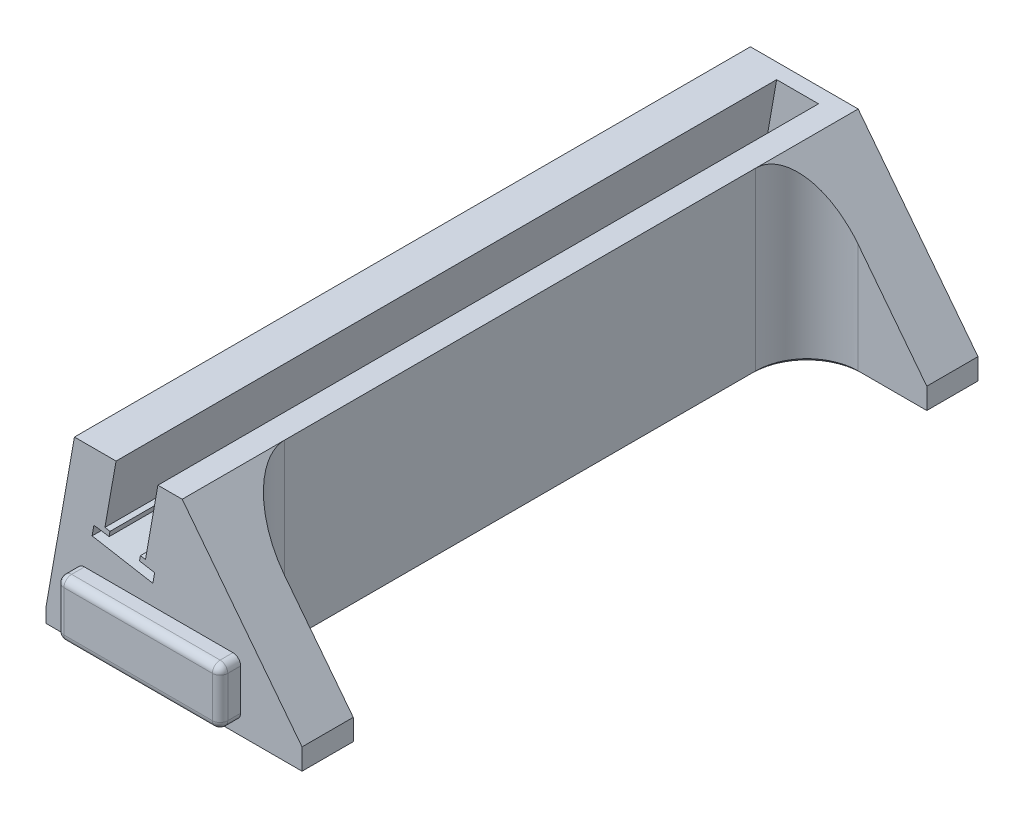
ISO-10303-21;
HEADER;
FILE_DESCRIPTION(('STEP AP214'),'2;1');
FILE_NAME('part.step','',(''),(''),'','','');
FILE_SCHEMA(('AUTOMOTIVE_DESIGN { 1 0 10303 214 1 1 1 1 }'));
ENDSEC;
DATA;
#1=APPLICATION_CONTEXT('core data for automotive mechanical design processes');
#2=APPLICATION_PROTOCOL_DEFINITION('international standard','automotive_design',2000,#1);
#3=PRODUCT_CONTEXT('',#1,'mechanical');
#4=PRODUCT('Part','Part','',(#3));
#5=PRODUCT_RELATED_PRODUCT_CATEGORY('part','',(#4));
#6=PRODUCT_DEFINITION_FORMATION('','',#4);
#7=PRODUCT_DEFINITION_CONTEXT('part definition',#1,'design');
#8=PRODUCT_DEFINITION('design','',#6,#7);
#9=PRODUCT_DEFINITION_SHAPE('','',#8);
#10=(LENGTH_UNIT() NAMED_UNIT(*) SI_UNIT(.MILLI.,.METRE.));
#11=(NAMED_UNIT(*) PLANE_ANGLE_UNIT() SI_UNIT($,.RADIAN.));
#12=(NAMED_UNIT(*) SI_UNIT($,.STERADIAN.) SOLID_ANGLE_UNIT());
#13=UNCERTAINTY_MEASURE_WITH_UNIT(LENGTH_MEASURE(1.E-05),#10,'distance_accuracy_value','');
#14=(GEOMETRIC_REPRESENTATION_CONTEXT(3) GLOBAL_UNCERTAINTY_ASSIGNED_CONTEXT((#13)) GLOBAL_UNIT_ASSIGNED_CONTEXT((#10,
#11,#12)) REPRESENTATION_CONTEXT('',''));
#15=CARTESIAN_POINT('',(0.,0.,0.));
#16=DIRECTION('',(0.,0.,1.));
#17=DIRECTION('',(1.,0.,0.));
#18=AXIS2_PLACEMENT_3D('',#15,#16,#17);
#19=CARTESIAN_POINT('',(-11.3201608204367,15.,132.));
#20=DIRECTION('',(-0.984807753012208,0.17364817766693,0.));
#21=DIRECTION('',(-0.17364817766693,-0.984807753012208,0.));
#22=AXIS2_PLACEMENT_3D('',#19,#20,#21);
#23=PLANE('',#22);
#24=DIRECTION('',(-0.17364817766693,-0.984807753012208,0.));
#25=VECTOR('',#24,1.);
#26=CARTESIAN_POINT('',(-11.3201608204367,15.,3.));
#27=LINE('',#26,#25);
#28=CARTESIAN_POINT('',(-11.3201608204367,15.,3.));
#29=VERTEX_POINT('',#28);
#30=CARTESIAN_POINT('',(-13.4913594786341,2.68652052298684,3.));
#31=VERTEX_POINT('',#30);
#32=EDGE_CURVE('E625',#29,#31,#27,.T.);
#33=ORIENTED_EDGE('',*,*,#32,.F.);
#34=DIRECTION('',(0.,0.,-1.));
#35=VECTOR('',#34,1.);
#36=CARTESIAN_POINT('',(-11.3201608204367,15.,132.));
#37=LINE('',#36,#35);
#38=CARTESIAN_POINT('',(-11.3201608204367,15.,132.));
#39=VERTEX_POINT('',#38);
#40=EDGE_CURVE('E525',#39,#29,#37,.T.);
#41=ORIENTED_EDGE('',*,*,#40,.F.);
#42=DIRECTION('',(0.17364817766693,0.984807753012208,0.));
#43=VECTOR('',#42,1.);
#44=CARTESIAN_POINT('',(-11.3201608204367,15.,132.));
#45=LINE('',#44,#43);
#46=CARTESIAN_POINT('',(-13.4913594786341,2.68652052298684,132.));
#47=VERTEX_POINT('',#46);
#48=EDGE_CURVE('E389',#47,#39,#45,.T.);
#49=ORIENTED_EDGE('',*,*,#48,.F.);
#50=DIRECTION('',(0.,0.,-1.));
#51=VECTOR('',#50,1.);
#52=CARTESIAN_POINT('',(-13.4913594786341,2.68652052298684,132.));
#53=LINE('',#52,#51);
#54=EDGE_CURVE('E446',#47,#31,#53,.T.);
#55=ORIENTED_EDGE('',*,*,#54,.T.);
#56=EDGE_LOOP('',(#33,#41,#49,#55));
#57=FACE_BOUND('',#56,.T.);
#58=ADVANCED_FACE('F40',(#57),#23,.F.);
#59=CARTESIAN_POINT('',(-5.57705108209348,1.21269145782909,132.));
#60=DIRECTION('',(0.984807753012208,-0.17364817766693,0.));
#61=DIRECTION('',(0.17364817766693,0.984807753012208,0.));
#62=AXIS2_PLACEMENT_3D('',#59,#60,#61);
#63=PLANE('',#62);
#64=DIRECTION('',(0.17364817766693,0.984807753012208,0.));
#65=VECTOR('',#64,1.);
#66=CARTESIAN_POINT('',(-5.57705108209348,1.21269145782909,3.));
#67=LINE('',#66,#65);
#68=CARTESIAN_POINT('',(-5.57705108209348,1.21269145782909,3.));
#69=VERTEX_POINT('',#68);
#70=CARTESIAN_POINT('',(-3.14597659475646,15.,3.));
#71=VERTEX_POINT('',#70);
#72=EDGE_CURVE('E1408',#69,#71,#67,.T.);
#73=ORIENTED_EDGE('',*,*,#72,.F.);
#74=DIRECTION('',(0.,0.,-1.));
#75=VECTOR('',#74,1.);
#76=CARTESIAN_POINT('',(-5.57705108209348,1.21269145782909,132.));
#77=LINE('',#76,#75);
#78=CARTESIAN_POINT('',(-5.57705108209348,1.21269145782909,132.));
#79=VERTEX_POINT('',#78);
#80=EDGE_CURVE('E501',#79,#69,#77,.T.);
#81=ORIENTED_EDGE('',*,*,#80,.F.);
#82=DIRECTION('',(-0.17364817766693,-0.984807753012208,0.));
#83=VECTOR('',#82,1.);
#84=CARTESIAN_POINT('',(-5.57705108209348,1.21269145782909,132.));
#85=LINE('',#84,#83);
#86=CARTESIAN_POINT('',(-3.14597659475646,15.,132.));
#87=VERTEX_POINT('',#86);
#88=EDGE_CURVE('E413',#87,#79,#85,.T.);
#89=ORIENTED_EDGE('',*,*,#88,.F.);
#90=DIRECTION('',(0.,0.,-1.));
#91=VECTOR('',#90,1.);
#92=CARTESIAN_POINT('',(-3.14597659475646,15.,132.));
#93=LINE('',#92,#91);
#94=EDGE_CURVE('E505',#87,#71,#93,.T.);
#95=ORIENTED_EDGE('',*,*,#94,.T.);
#96=EDGE_LOOP('',(#73,#81,#89,#95));
#97=FACE_BOUND('',#96,.T.);
#98=ADVANCED_FACE('F836',(#97),#63,.F.);
#99=CARTESIAN_POINT('',(-5.57705108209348,1.21269145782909,132.));
#100=DIRECTION('',(-0.17364817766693,-0.984807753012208,0.));
#101=DIRECTION('',(0.984807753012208,-0.17364817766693,0.));
#102=AXIS2_PLACEMENT_3D('',#99,#100,#101);
#103=PLANE('',#102);
#104=DIRECTION('',(0.984807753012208,-0.17364817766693,0.));
#105=VECTOR('',#104,1.);
#106=CARTESIAN_POINT('',(-5.57705108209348,1.21269145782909,3.));
#107=LINE('',#106,#105);
#108=CARTESIAN_POINT('',(-6.56185883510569,1.38633963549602,3.));
#109=VERTEX_POINT('',#108);
#110=EDGE_CURVE('E1467',#109,#69,#107,.T.);
#111=ORIENTED_EDGE('',*,*,#110,.F.);
#112=DIRECTION('',(0.,0.,-1.));
#113=VECTOR('',#112,1.);
#114=CARTESIAN_POINT('',(-6.56185883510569,1.38633963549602,132.));
#115=LINE('',#114,#113);
#116=CARTESIAN_POINT('',(-6.56185883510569,1.38633963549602,132.));
#117=VERTEX_POINT('',#116);
#118=EDGE_CURVE('E497',#117,#109,#115,.T.);
#119=ORIENTED_EDGE('',*,*,#118,.F.);
#120=DIRECTION('',(-0.984807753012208,0.17364817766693,0.));
#121=VECTOR('',#120,1.);
#122=CARTESIAN_POINT('',(-5.57705108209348,1.21269145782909,132.));
#123=LINE('',#122,#121);
#124=EDGE_CURVE('E416',#79,#117,#123,.T.);
#125=ORIENTED_EDGE('',*,*,#124,.F.);
#126=ORIENTED_EDGE('',*,*,#80,.T.);
#127=EDGE_LOOP('',(#111,#119,#125,#126));
#128=FACE_BOUND('',#127,.T.);
#129=ADVANCED_FACE('F843',(#128),#103,.F.);
#130=CARTESIAN_POINT('',(-6.73550701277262,0.401531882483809,132.));
#131=DIRECTION('',(0.984807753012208,-0.173648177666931,0.));
#132=DIRECTION('',(0.173648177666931,0.984807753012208,0.));
#133=AXIS2_PLACEMENT_3D('',#130,#131,#132);
#134=PLANE('',#133);
#135=DIRECTION('',(0.173648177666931,0.984807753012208,0.));
#136=VECTOR('',#135,1.);
#137=CARTESIAN_POINT('',(-6.73550701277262,0.401531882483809,3.));
#138=LINE('',#137,#136);
#139=CARTESIAN_POINT('',(-6.73550701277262,0.401531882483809,3.));
#140=VERTEX_POINT('',#139);
#141=EDGE_CURVE('E1416',#140,#109,#138,.T.);
#142=ORIENTED_EDGE('',*,*,#141,.F.);
#143=DIRECTION('',(0.,0.,-1.));
#144=VECTOR('',#143,1.);
#145=CARTESIAN_POINT('',(-6.73550701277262,0.401531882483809,132.));
#146=LINE('',#145,#144);
#147=CARTESIAN_POINT('',(-6.73550701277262,0.401531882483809,132.));
#148=VERTEX_POINT('',#147);
#149=EDGE_CURVE('E493',#148,#140,#146,.T.);
#150=ORIENTED_EDGE('',*,*,#149,.F.);
#151=DIRECTION('',(-0.173648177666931,-0.984807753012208,0.));
#152=VECTOR('',#151,1.);
#153=CARTESIAN_POINT('',(-6.73550701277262,0.401531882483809,132.));
#154=LINE('',#153,#152);
#155=EDGE_CURVE('E419',#117,#148,#154,.T.);
#156=ORIENTED_EDGE('',*,*,#155,.F.);
#157=ORIENTED_EDGE('',*,*,#118,.T.);
#158=EDGE_LOOP('',(#142,#150,#156,#157));
#159=FACE_BOUND('',#158,.T.);
#160=ADVANCED_FACE('F1202',(#159),#134,.F.);
#161=CARTESIAN_POINT('',(-5.75069925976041,0.227883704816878,132.));
#162=DIRECTION('',(0.173648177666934,0.984807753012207,0.));
#163=DIRECTION('',(-0.984807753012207,0.173648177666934,0.));
#164=AXIS2_PLACEMENT_3D('',#161,#162,#163);
#165=PLANE('',#164);
#166=DIRECTION('',(-0.984807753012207,0.173648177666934,0.));
#167=VECTOR('',#166,1.);
#168=CARTESIAN_POINT('',(-5.75069925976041,0.227883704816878,3.));
#169=LINE('',#168,#167);
#170=CARTESIAN_POINT('',(-3.781083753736,-0.119412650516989,3.));
#171=VERTEX_POINT('',#170);
#172=EDGE_CURVE('E1419',#171,#140,#169,.T.);
#173=ORIENTED_EDGE('',*,*,#172,.F.);
#174=DIRECTION('',(0.,0.,-1.));
#175=VECTOR('',#174,1.);
#176=CARTESIAN_POINT('',(-3.781083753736,-0.119412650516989,132.));
#177=LINE('',#176,#175);
#178=CARTESIAN_POINT('',(-3.781083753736,-0.119412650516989,132.));
#179=VERTEX_POINT('',#178);
#180=EDGE_CURVE('E489',#179,#171,#177,.T.);
#181=ORIENTED_EDGE('',*,*,#180,.F.);
#182=DIRECTION('',(0.984807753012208,-0.173648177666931,0.));
#183=VECTOR('',#182,1.);
#184=CARTESIAN_POINT('',(-5.75069925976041,0.227883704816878,132.));
#185=LINE('',#184,#183);
#186=EDGE_CURVE('E422',#148,#179,#185,.T.);
#187=ORIENTED_EDGE('',*,*,#186,.F.);
#188=ORIENTED_EDGE('',*,*,#149,.T.);
#189=EDGE_LOOP('',(#173,#181,#187,#188));
#190=FACE_BOUND('',#189,.T.);
#191=ADVANCED_FACE('F1211',(#190),#165,.F.);
#192=CARTESIAN_POINT('',(-3.781083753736,-0.119412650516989,132.));
#193=DIRECTION('',(0.984807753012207,-0.173648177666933,0.));
#194=DIRECTION('',(0.173648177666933,0.984807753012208,0.));
#195=AXIS2_PLACEMENT_3D('',#192,#193,#194);
#196=PLANE('',#195);
#197=DIRECTION('',(0.173648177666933,0.984807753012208,0.));
#198=VECTOR('',#197,1.);
#199=CARTESIAN_POINT('',(-3.781083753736,-0.119412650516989,3.));
#200=LINE('',#199,#198);
#201=CARTESIAN_POINT('',(-4.12838010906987,-2.0890281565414,3.));
#202=VERTEX_POINT('',#201);
#203=EDGE_CURVE('E1460',#202,#171,#200,.T.);
#204=ORIENTED_EDGE('',*,*,#203,.F.);
#205=DIRECTION('',(0.,0.,-1.));
#206=VECTOR('',#205,1.);
#207=CARTESIAN_POINT('',(-4.12838010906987,-2.0890281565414,132.));
#208=LINE('',#207,#206);
#209=CARTESIAN_POINT('',(-4.12838010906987,-2.0890281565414,132.));
#210=VERTEX_POINT('',#209);
#211=EDGE_CURVE('E485',#210,#202,#208,.T.);
#212=ORIENTED_EDGE('',*,*,#211,.F.);
#213=DIRECTION('',(-0.173648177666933,-0.984807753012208,0.));
#214=VECTOR('',#213,1.);
#215=CARTESIAN_POINT('',(-3.781083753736,-0.119412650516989,132.));
#216=LINE('',#215,#214);
#217=EDGE_CURVE('E425',#179,#210,#216,.T.);
#218=ORIENTED_EDGE('',*,*,#217,.F.);
#219=ORIENTED_EDGE('',*,*,#180,.T.);
#220=EDGE_LOOP('',(#204,#212,#218,#219));
#221=FACE_BOUND('',#220,.T.);
#222=ADVANCED_FACE('F1221',(#221),#196,.F.);
#223=CARTESIAN_POINT('',(-15.995313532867,0.00343238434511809,132.));
#224=DIRECTION('',(-0.173648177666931,-0.984807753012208,0.));
#225=DIRECTION('',(0.984807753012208,-0.173648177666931,0.));
#226=AXIS2_PLACEMENT_3D('',#223,#224,#225);
#227=PLANE('',#226);
#228=DIRECTION('',(0.984807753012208,-0.173648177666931,0.));
#229=VECTOR('',#228,1.);
#230=CARTESIAN_POINT('',(-15.995313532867,0.00343238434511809,3.));
#231=LINE('',#230,#229);
#232=CARTESIAN_POINT('',(-15.995313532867,0.00343238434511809,3.));
#233=VERTEX_POINT('',#232);
#234=EDGE_CURVE('E1427',#233,#202,#231,.T.);
#235=ORIENTED_EDGE('',*,*,#234,.F.);
#236=DIRECTION('',(0.,0.,-1.));
#237=VECTOR('',#236,1.);
#238=CARTESIAN_POINT('',(-15.995313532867,0.00343238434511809,132.));
#239=LINE('',#238,#237);
#240=CARTESIAN_POINT('',(-15.995313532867,0.00343238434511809,132.));
#241=VERTEX_POINT('',#240);
#242=EDGE_CURVE('E481',#241,#233,#239,.T.);
#243=ORIENTED_EDGE('',*,*,#242,.F.);
#244=DIRECTION('',(-0.984807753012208,0.173648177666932,0.));
#245=VECTOR('',#244,1.);
#246=CARTESIAN_POINT('',(-15.995313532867,0.00343238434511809,132.));
#247=LINE('',#246,#245);
#248=EDGE_CURVE('E428',#210,#241,#247,.T.);
#249=ORIENTED_EDGE('',*,*,#248,.F.);
#250=ORIENTED_EDGE('',*,*,#211,.T.);
#251=EDGE_LOOP('',(#235,#243,#249,#250));
#252=FACE_BOUND('',#251,.T.);
#253=ADVANCED_FACE('F1230',(#252),#227,.F.);
#254=CARTESIAN_POINT('',(-15.6465519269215,1.97278896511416,132.));
#255=DIRECTION('',(-0.984678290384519,0.174380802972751,0.));
#256=DIRECTION('',(-0.174380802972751,-0.984678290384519,0.));
#257=AXIS2_PLACEMENT_3D('',#254,#255,#256);
#258=PLANE('',#257);
#259=DIRECTION('',(-0.174380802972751,-0.984678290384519,0.));
#260=VECTOR('',#259,1.);
#261=CARTESIAN_POINT('',(-15.6465519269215,1.97278896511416,3.));
#262=LINE('',#261,#260);
#263=CARTESIAN_POINT('',(-15.6465519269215,1.97278896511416,3.));
#264=VERTEX_POINT('',#263);
#265=EDGE_CURVE('E1430',#264,#233,#262,.T.);
#266=ORIENTED_EDGE('',*,*,#265,.F.);
#267=DIRECTION('',(0.,0.,-1.));
#268=VECTOR('',#267,1.);
#269=CARTESIAN_POINT('',(-15.6465519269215,1.97278896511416,132.));
#270=LINE('',#269,#268);
#271=CARTESIAN_POINT('',(-15.6465519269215,1.97278896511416,132.));
#272=VERTEX_POINT('',#271);
#273=EDGE_CURVE('E477',#272,#264,#270,.T.);
#274=ORIENTED_EDGE('',*,*,#273,.F.);
#275=DIRECTION('',(0.174380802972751,0.984678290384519,0.));
#276=VECTOR('',#275,1.);
#277=CARTESIAN_POINT('',(-15.6465519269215,1.97278896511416,132.));
#278=LINE('',#277,#276);
#279=EDGE_CURVE('E431',#241,#272,#278,.T.);
#280=ORIENTED_EDGE('',*,*,#279,.F.);
#281=ORIENTED_EDGE('',*,*,#242,.T.);
#282=EDGE_LOOP('',(#266,#274,#280,#281));
#283=FACE_BOUND('',#282,.T.);
#284=ADVANCED_FACE('F1239',(#283),#258,.F.);
#285=CARTESIAN_POINT('',(-13.665007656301,1.70171276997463,132.));
#286=DIRECTION('',(0.135538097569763,0.990772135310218,0.));
#287=DIRECTION('',(-0.990772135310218,0.135538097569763,0.));
#288=AXIS2_PLACEMENT_3D('',#285,#286,#287);
#289=PLANE('',#288);
#290=DIRECTION('',(-0.990772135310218,0.135538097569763,0.));
#291=VECTOR('',#290,1.);
#292=CARTESIAN_POINT('',(-13.665007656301,1.70171276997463,3.));
#293=LINE('',#292,#291);
#294=CARTESIAN_POINT('',(-13.665007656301,1.70171276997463,3.));
#295=VERTEX_POINT('',#294);
#296=EDGE_CURVE('E1453',#295,#264,#293,.T.);
#297=ORIENTED_EDGE('',*,*,#296,.F.);
#298=DIRECTION('',(0.,0.,-1.));
#299=VECTOR('',#298,1.);
#300=CARTESIAN_POINT('',(-13.665007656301,1.70171276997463,132.));
#301=LINE('',#300,#299);
#302=CARTESIAN_POINT('',(-13.665007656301,1.70171276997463,132.));
#303=VERTEX_POINT('',#302);
#304=EDGE_CURVE('E473',#303,#295,#301,.T.);
#305=ORIENTED_EDGE('',*,*,#304,.F.);
#306=DIRECTION('',(0.990772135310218,-0.135538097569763,0.));
#307=VECTOR('',#306,1.);
#308=CARTESIAN_POINT('',(-13.665007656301,1.70171276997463,132.));
#309=LINE('',#308,#307);
#310=EDGE_CURVE('E434',#272,#303,#309,.T.);
#311=ORIENTED_EDGE('',*,*,#310,.F.);
#312=ORIENTED_EDGE('',*,*,#273,.T.);
#313=EDGE_LOOP('',(#297,#305,#311,#312));
#314=FACE_BOUND('',#313,.T.);
#315=ADVANCED_FACE('F1248',(#314),#289,.F.);
#316=CARTESIAN_POINT('',(-13.665007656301,1.70171276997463,132.));
#317=DIRECTION('',(0.17364817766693,0.984807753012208,0.));
#318=DIRECTION('',(-0.984807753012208,0.17364817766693,0.));
#319=AXIS2_PLACEMENT_3D('',#316,#317,#318);
#320=PLANE('',#319);
#321=DIRECTION('',(-0.984807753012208,0.17364817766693,0.));
#322=VECTOR('',#321,1.);
#323=CARTESIAN_POINT('',(-13.665007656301,1.70171276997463,3.));
#324=LINE('',#323,#322);
#325=CARTESIAN_POINT('',(-12.6801999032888,1.5280645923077,3.));
#326=VERTEX_POINT('',#325);
#327=EDGE_CURVE('E1438',#326,#295,#324,.T.);
#328=ORIENTED_EDGE('',*,*,#327,.F.);
#329=DIRECTION('',(0.,0.,-1.));
#330=VECTOR('',#329,1.);
#331=CARTESIAN_POINT('',(-12.6801999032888,1.5280645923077,132.));
#332=LINE('',#331,#330);
#333=CARTESIAN_POINT('',(-12.6801999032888,1.5280645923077,132.));
#334=VERTEX_POINT('',#333);
#335=EDGE_CURVE('E469',#334,#326,#332,.T.);
#336=ORIENTED_EDGE('',*,*,#335,.F.);
#337=DIRECTION('',(0.984807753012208,-0.17364817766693,0.));
#338=VECTOR('',#337,1.);
#339=CARTESIAN_POINT('',(-13.665007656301,1.70171276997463,132.));
#340=LINE('',#339,#338);
#341=EDGE_CURVE('E437',#303,#334,#340,.T.);
#342=ORIENTED_EDGE('',*,*,#341,.F.);
#343=ORIENTED_EDGE('',*,*,#304,.T.);
#344=EDGE_LOOP('',(#328,#336,#342,#343));
#345=FACE_BOUND('',#344,.T.);
#346=ADVANCED_FACE('F1257',(#345),#320,.F.);
#347=CARTESIAN_POINT('',(-12.6801999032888,1.5280645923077,132.));
#348=DIRECTION('',(-0.984807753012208,0.173648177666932,0.));
#349=DIRECTION('',(-0.173648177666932,-0.984807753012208,0.));
#350=AXIS2_PLACEMENT_3D('',#347,#348,#349);
#351=PLANE('',#350);
#352=DIRECTION('',(-0.173648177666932,-0.984807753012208,0.));
#353=VECTOR('',#352,1.);
#354=CARTESIAN_POINT('',(-12.6801999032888,1.5280645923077,3.));
#355=LINE('',#354,#353);
#356=CARTESIAN_POINT('',(-12.5065517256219,2.51287234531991,3.));
#357=VERTEX_POINT('',#356);
#358=EDGE_CURVE('E1441',#357,#326,#355,.T.);
#359=ORIENTED_EDGE('',*,*,#358,.F.);
#360=DIRECTION('',(0.,0.,-1.));
#361=VECTOR('',#360,1.);
#362=CARTESIAN_POINT('',(-12.5065517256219,2.51287234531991,132.));
#363=LINE('',#362,#361);
#364=CARTESIAN_POINT('',(-12.5065517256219,2.51287234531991,132.));
#365=VERTEX_POINT('',#364);
#366=EDGE_CURVE('E465',#365,#357,#363,.T.);
#367=ORIENTED_EDGE('',*,*,#366,.F.);
#368=DIRECTION('',(0.173648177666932,0.984807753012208,0.));
#369=VECTOR('',#368,1.);
#370=CARTESIAN_POINT('',(-12.6801999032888,1.5280645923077,132.));
#371=LINE('',#370,#369);
#372=EDGE_CURVE('E440',#334,#365,#371,.T.);
#373=ORIENTED_EDGE('',*,*,#372,.F.);
#374=ORIENTED_EDGE('',*,*,#335,.T.);
#375=EDGE_LOOP('',(#359,#367,#373,#374));
#376=FACE_BOUND('',#375,.T.);
#377=ADVANCED_FACE('F1266',(#376),#351,.F.);
#378=CARTESIAN_POINT('',(-13.4913594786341,2.68652052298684,132.));
#379=DIRECTION('',(-0.17364817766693,-0.984807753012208,0.));
#380=DIRECTION('',(0.984807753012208,-0.17364817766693,0.));
#381=AXIS2_PLACEMENT_3D('',#378,#379,#380);
#382=PLANE('',#381);
#383=DIRECTION('',(0.984807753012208,-0.17364817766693,0.));
#384=VECTOR('',#383,1.);
#385=CARTESIAN_POINT('',(-13.4913594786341,2.68652052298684,3.));
#386=LINE('',#385,#384);
#387=EDGE_CURVE('E620',#31,#357,#386,.T.);
#388=ORIENTED_EDGE('',*,*,#387,.F.);
#389=ORIENTED_EDGE('',*,*,#54,.F.);
#390=DIRECTION('',(-0.984807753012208,0.17364817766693,0.));
#391=VECTOR('',#390,1.);
#392=CARTESIAN_POINT('',(-13.4913594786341,2.68652052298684,132.));
#393=LINE('',#392,#391);
#394=EDGE_CURVE('E443',#365,#47,#393,.T.);
#395=ORIENTED_EDGE('',*,*,#394,.F.);
#396=ORIENTED_EDGE('',*,*,#366,.T.);
#397=EDGE_LOOP('',(#388,#389,#395,#396));
#398=FACE_BOUND('',#397,.T.);
#399=ADVANCED_FACE('F1275',(#398),#382,.F.);
#400=CARTESIAN_POINT('',(0.,0.,132.));
#401=DIRECTION('',(0.,0.,1.));
#402=DIRECTION('',(1.,0.,0.));
#403=AXIS2_PLACEMENT_3D('',#400,#401,#402);
#404=PLANE('',#403);
#405=DIRECTION('',(0.,-1.,0.));
#406=VECTOR('',#405,1.);
#407=CARTESIAN_POINT('',(-25.,-16.5120593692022,132.));
#408=LINE('',#407,#406);
#409=CARTESIAN_POINT('',(-25.,-16.5120593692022,132.));
#410=VERTEX_POINT('',#409);
#411=CARTESIAN_POINT('',(-25.,-19.3,132.));
#412=VERTEX_POINT('',#411);
#413=EDGE_CURVE('E400',#410,#412,#408,.T.);
#414=ORIENTED_EDGE('',*,*,#413,.T.);
#415=DIRECTION('',(1.,0.,0.));
#416=VECTOR('',#415,1.);
#417=CARTESIAN_POINT('',(25.,-19.3,132.));
#418=LINE('',#417,#416);
#419=CARTESIAN_POINT('',(25.,-19.3,132.));
#420=VERTEX_POINT('',#419);
#421=EDGE_CURVE('E723',#412,#420,#418,.T.);
#422=ORIENTED_EDGE('',*,*,#421,.T.);
#423=DIRECTION('',(0.,1.,0.));
#424=VECTOR('',#423,1.);
#425=CARTESIAN_POINT('',(25.,-15.1841895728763,132.));
#426=LINE('',#425,#424);
#427=CARTESIAN_POINT('',(25.,-15.1841895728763,132.));
#428=VERTEX_POINT('',#427);
#429=EDGE_CURVE('E404',#420,#428,#426,.T.);
#430=ORIENTED_EDGE('',*,*,#429,.T.);
#431=DIRECTION('',(-0.612756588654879,0.790271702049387,0.));
#432=VECTOR('',#431,1.);
#433=CARTESIAN_POINT('',(25.,-15.1841895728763,132.));
#434=LINE('',#433,#432);
#435=CARTESIAN_POINT('',(1.59594670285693,15.,132.));
#436=VERTEX_POINT('',#435);
#437=EDGE_CURVE('E407',#428,#436,#434,.T.);
#438=ORIENTED_EDGE('',*,*,#437,.T.);
#439=DIRECTION('',(-1.,0.,0.));
#440=VECTOR('',#439,1.);
#441=CARTESIAN_POINT('',(-3.14597659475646,15.,132.));
#442=LINE('',#441,#440);
#443=EDGE_CURVE('E410',#436,#87,#442,.T.);
#444=ORIENTED_EDGE('',*,*,#443,.T.);
#445=ORIENTED_EDGE('',*,*,#88,.T.);
#446=ORIENTED_EDGE('',*,*,#124,.T.);
#447=ORIENTED_EDGE('',*,*,#155,.T.);
#448=ORIENTED_EDGE('',*,*,#186,.T.);
#449=ORIENTED_EDGE('',*,*,#217,.T.);
#450=ORIENTED_EDGE('',*,*,#248,.T.);
#451=ORIENTED_EDGE('',*,*,#279,.T.);
#452=ORIENTED_EDGE('',*,*,#310,.T.);
#453=ORIENTED_EDGE('',*,*,#341,.T.);
#454=ORIENTED_EDGE('',*,*,#372,.T.);
#455=ORIENTED_EDGE('',*,*,#394,.T.);
#456=ORIENTED_EDGE('',*,*,#48,.T.);
#457=DIRECTION('',(-1.,0.,0.));
#458=VECTOR('',#457,1.);
#459=CARTESIAN_POINT('',(-19.4435737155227,15.,132.));
#460=LINE('',#459,#458);
#461=CARTESIAN_POINT('',(-19.4435737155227,15.,132.));
#462=VERTEX_POINT('',#461);
#463=EDGE_CURVE('E393',#39,#462,#460,.T.);
#464=ORIENTED_EDGE('',*,*,#463,.T.);
#465=DIRECTION('',(-0.173648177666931,-0.984807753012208,0.));
#466=VECTOR('',#465,1.);
#467=CARTESIAN_POINT('',(-19.4435737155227,15.,132.));
#468=LINE('',#467,#466);
#469=EDGE_CURVE('E397',#462,#410,#468,.T.);
#470=ORIENTED_EDGE('',*,*,#469,.T.);
#471=EDGE_LOOP('',(#414,#422,#430,#438,#444,#445,#446,#447,#448,#449,#450,#451,#452,#453,#454,
#455,#456,#464,#470));
#472=FACE_BOUND('',#471,.T.);
#473=DIRECTION('',(1.,0.,0.));
#474=VECTOR('',#473,1.);
#475=CARTESIAN_POINT('',(-19.,-17.,132.));
#476=LINE('',#475,#474);
#477=CARTESIAN_POINT('',(-17.5,-17.,132.));
#478=VERTEX_POINT('',#477);
#479=CARTESIAN_POINT('',(11.5,-17.,132.));
#480=VERTEX_POINT('',#479);
#481=EDGE_CURVE('E1477',#478,#480,#476,.T.);
#482=ORIENTED_EDGE('',*,*,#481,.F.);
#483=CARTESIAN_POINT('',(-17.5,-15.5,132.));
#484=DIRECTION('',(0.,0.,1.));
#485=DIRECTION('',(1.,0.,0.));
#486=AXIS2_PLACEMENT_3D('',#483,#484,#485);
#487=CIRCLE('',#486,1.5);
#488=CARTESIAN_POINT('',(-19.,-15.5,132.));
#489=VERTEX_POINT('',#488);
#490=EDGE_CURVE('E608',#478,#489,#487,.F.);
#491=ORIENTED_EDGE('',*,*,#490,.T.);
#492=DIRECTION('',(0.,-1.,0.));
#493=VECTOR('',#492,1.);
#494=CARTESIAN_POINT('',(-19.,-6.00000000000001,132.));
#495=LINE('',#494,#493);
#496=CARTESIAN_POINT('',(-19.,-7.50000000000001,132.));
#497=VERTEX_POINT('',#496);
#498=EDGE_CURVE('E668',#497,#489,#495,.T.);
#499=ORIENTED_EDGE('',*,*,#498,.F.);
#500=CARTESIAN_POINT('',(-17.5,-7.50000000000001,132.));
#501=DIRECTION('',(0.,0.,1.));
#502=DIRECTION('',(1.,0.,0.));
#503=AXIS2_PLACEMENT_3D('',#500,#501,#502);
#504=CIRCLE('',#503,1.5);
#505=CARTESIAN_POINT('',(-17.5,-6.00000000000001,132.));
#506=VERTEX_POINT('',#505);
#507=EDGE_CURVE('E611',#497,#506,#504,.F.);
#508=ORIENTED_EDGE('',*,*,#507,.T.);
#509=DIRECTION('',(-1.,0.,0.));
#510=VECTOR('',#509,1.);
#511=CARTESIAN_POINT('',(-19.,-6.00000000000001,132.));
#512=LINE('',#511,#510);
#513=CARTESIAN_POINT('',(11.5,-6.00000000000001,132.));
#514=VERTEX_POINT('',#513);
#515=EDGE_CURVE('E358',#514,#506,#512,.T.);
#516=ORIENTED_EDGE('',*,*,#515,.F.);
#517=CARTESIAN_POINT('',(11.5,-7.50000000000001,132.));
#518=DIRECTION('',(0.,0.,1.));
#519=DIRECTION('',(1.,0.,0.));
#520=AXIS2_PLACEMENT_3D('',#517,#518,#519);
#521=CIRCLE('',#520,1.5);
#522=CARTESIAN_POINT('',(13.,-7.5,132.));
#523=VERTEX_POINT('',#522);
#524=EDGE_CURVE('E617',#514,#523,#521,.F.);
#525=ORIENTED_EDGE('',*,*,#524,.T.);
#526=DIRECTION('',(0.,1.,0.));
#527=VECTOR('',#526,1.);
#528=CARTESIAN_POINT('',(13.,-6.00000000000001,132.));
#529=LINE('',#528,#527);
#530=CARTESIAN_POINT('',(13.,-15.5,132.));
#531=VERTEX_POINT('',#530);
#532=EDGE_CURVE('E362',#531,#523,#529,.T.);
#533=ORIENTED_EDGE('',*,*,#532,.F.);
#534=CARTESIAN_POINT('',(11.5,-15.5,132.));
#535=DIRECTION('',(0.,0.,1.));
#536=DIRECTION('',(1.,0.,0.));
#537=AXIS2_PLACEMENT_3D('',#534,#535,#536);
#538=CIRCLE('',#537,1.5);
#539=EDGE_CURVE('E614',#531,#480,#538,.F.);
#540=ORIENTED_EDGE('',*,*,#539,.T.);
#541=EDGE_LOOP('',(#482,#491,#499,#508,#516,#525,#533,#540));
#542=FACE_BOUND('',#541,.T.);
#543=ADVANCED_FACE('F1283',(#472,#542),#404,.T.);
#544=CARTESIAN_POINT('',(25.,-15.1841895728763,132.));
#545=DIRECTION('',(-1.,0.,0.));
#546=DIRECTION('',(0.,0.,1.));
#547=AXIS2_PLACEMENT_3D('',#544,#545,#546);
#548=PLANE('',#547);
#549=DIRECTION('',(0.,1.,0.));
#550=VECTOR('',#549,1.);
#551=CARTESIAN_POINT('',(25.,-20.,10.));
#552=LINE('',#551,#550);
#553=CARTESIAN_POINT('',(25.,-19.3,10.));
#554=VERTEX_POINT('',#553);
#555=CARTESIAN_POINT('',(25.,-15.1841895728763,10.));
#556=VERTEX_POINT('',#555);
#557=EDGE_CURVE('E383',#554,#556,#552,.T.);
#558=ORIENTED_EDGE('',*,*,#557,.F.);
#559=DIRECTION('',(0.,0.,-1.));
#560=VECTOR('',#559,1.);
#561=CARTESIAN_POINT('',(25.,-19.3,132.));
#562=LINE('',#561,#560);
#563=CARTESIAN_POINT('',(25.,-19.3,0.));
#564=VERTEX_POINT('',#563);
#565=EDGE_CURVE('E744',#554,#564,#562,.T.);
#566=ORIENTED_EDGE('',*,*,#565,.T.);
#567=DIRECTION('',(0.,1.,0.));
#568=VECTOR('',#567,1.);
#569=CARTESIAN_POINT('',(25.,-15.1841895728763,0.));
#570=LINE('',#569,#568);
#571=CARTESIAN_POINT('',(25.,-15.1841895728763,0.));
#572=VERTEX_POINT('',#571);
#573=EDGE_CURVE('E453',#564,#572,#570,.T.);
#574=ORIENTED_EDGE('',*,*,#573,.T.);
#575=DIRECTION('',(0.,0.,-1.));
#576=VECTOR('',#575,1.);
#577=CARTESIAN_POINT('',(25.,-15.1841895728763,132.));
#578=LINE('',#577,#576);
#579=EDGE_CURVE('E512',#556,#572,#578,.T.);
#580=ORIENTED_EDGE('',*,*,#579,.F.);
#581=EDGE_LOOP('',(#558,#566,#574,#580));
#582=FACE_BOUND('',#581,.T.);
#583=ADVANCED_FACE('F1291',(#582),#548,.F.);
#584=CARTESIAN_POINT('',(25.,-15.1841895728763,132.));
#585=DIRECTION('',(-0.790271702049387,-0.612756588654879,0.));
#586=DIRECTION('',(0.612756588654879,-0.790271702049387,0.));
#587=AXIS2_PLACEMENT_3D('',#584,#585,#586);
#588=PLANE('',#587);
#589=DIRECTION('',(0.,0.,-1.));
#590=VECTOR('',#589,1.);
#591=CARTESIAN_POINT('',(1.59594670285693,15.,132.));
#592=LINE('',#591,#590);
#593=CARTESIAN_POINT('',(1.59594670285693,15.,20.));
#594=VERTEX_POINT('',#593);
#595=CARTESIAN_POINT('',(1.59594670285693,15.,0.));
#596=VERTEX_POINT('',#595);
#597=EDGE_CURVE('E508',#594,#596,#592,.T.);
#598=ORIENTED_EDGE('',*,*,#597,.F.);
#599=CARTESIAN_POINT('',(11.5959467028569,2.10300767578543,20.));
#600=DIRECTION('',(-0.790271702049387,-0.612756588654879,0.));
#601=DIRECTION('',(0.612756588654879,-0.790271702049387,0.));
#602=AXIS2_PLACEMENT_3D('',#599,#600,#601);
#603=ELLIPSE('',#602,16.3196939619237,10.);
#604=CARTESIAN_POINT('',(11.5959467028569,2.10300767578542,9.99999999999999));
#605=VERTEX_POINT('',#604);
#606=EDGE_CURVE('E555',#594,#605,#603,.T.);
#607=ORIENTED_EDGE('',*,*,#606,.T.);
#608=DIRECTION('',(0.612756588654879,-0.790271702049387,0.));
#609=VECTOR('',#608,1.);
#610=CARTESIAN_POINT('',(25.,-15.1841895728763,9.99999999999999));
#611=LINE('',#610,#609);
#612=EDGE_CURVE('E533',#605,#556,#611,.T.);
#613=ORIENTED_EDGE('',*,*,#612,.T.);
#614=ORIENTED_EDGE('',*,*,#579,.T.);
#615=DIRECTION('',(-0.612756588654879,0.790271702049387,0.));
#616=VECTOR('',#615,1.);
#617=CARTESIAN_POINT('',(25.,-15.1841895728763,0.));
#618=LINE('',#617,#616);
#619=EDGE_CURVE('E456',#572,#596,#618,.T.);
#620=ORIENTED_EDGE('',*,*,#619,.T.);
#621=EDGE_LOOP('',(#598,#607,#613,#614,#620));
#622=FACE_BOUND('',#621,.T.);
#623=ADVANCED_FACE('F1299',(#622),#588,.F.);
#624=CARTESIAN_POINT('',(-19.4435737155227,15.,132.));
#625=DIRECTION('',(0.984807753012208,-0.173648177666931,0.));
#626=DIRECTION('',(0.173648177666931,0.984807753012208,0.));
#627=AXIS2_PLACEMENT_3D('',#624,#625,#626);
#628=PLANE('',#627);
#629=DIRECTION('',(-0.173648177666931,-0.984807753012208,0.));
#630=VECTOR('',#629,1.);
#631=CARTESIAN_POINT('',(-19.4435737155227,15.,0.));
#632=LINE('',#631,#630);
#633=CARTESIAN_POINT('',(-19.4435737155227,15.,0.));
#634=VERTEX_POINT('',#633);
#635=CARTESIAN_POINT('',(-25.,-16.5120593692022,0.));
#636=VERTEX_POINT('',#635);
#637=EDGE_CURVE('E386',#634,#636,#632,.T.);
#638=ORIENTED_EDGE('',*,*,#637,.T.);
#639=DIRECTION('',(0.,0.,-1.));
#640=VECTOR('',#639,1.);
#641=CARTESIAN_POINT('',(-25.,-16.5120593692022,132.));
#642=LINE('',#641,#640);
#643=EDGE_CURVE('E517',#410,#636,#642,.T.);
#644=ORIENTED_EDGE('',*,*,#643,.F.);
#645=ORIENTED_EDGE('',*,*,#469,.F.);
#646=DIRECTION('',(0.,0.,-1.));
#647=VECTOR('',#646,1.);
#648=CARTESIAN_POINT('',(-19.4435737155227,15.,132.));
#649=LINE('',#648,#647);
#650=EDGE_CURVE('E521',#462,#634,#649,.T.);
#651=ORIENTED_EDGE('',*,*,#650,.T.);
#652=EDGE_LOOP('',(#638,#644,#645,#651));
#653=FACE_BOUND('',#652,.T.);
#654=ADVANCED_FACE('F848',(#653),#628,.F.);
#655=CARTESIAN_POINT('',(-25.,-16.5120593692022,132.));
#656=DIRECTION('',(1.,0.,0.));
#657=DIRECTION('',(0.,1.,0.));
#658=AXIS2_PLACEMENT_3D('',#655,#656,#657);
#659=PLANE('',#658);
#660=DIRECTION('',(0.,-1.,0.));
#661=VECTOR('',#660,1.);
#662=CARTESIAN_POINT('',(-25.,-16.5120593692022,0.));
#663=LINE('',#662,#661);
#664=CARTESIAN_POINT('',(-25.,-19.3,0.));
#665=VERTEX_POINT('',#664);
#666=EDGE_CURVE('E449',#636,#665,#663,.T.);
#667=ORIENTED_EDGE('',*,*,#666,.T.);
#668=DIRECTION('',(0.,0.,1.));
#669=VECTOR('',#668,1.);
#670=CARTESIAN_POINT('',(-25.,-19.3,132.));
#671=LINE('',#670,#669);
#672=EDGE_CURVE('E720',#665,#412,#671,.T.);
#673=ORIENTED_EDGE('',*,*,#672,.T.);
#674=ORIENTED_EDGE('',*,*,#413,.F.);
#675=ORIENTED_EDGE('',*,*,#643,.T.);
#676=EDGE_LOOP('',(#667,#673,#674,#675));
#677=FACE_BOUND('',#676,.T.);
#678=ADVANCED_FACE('F1332',(#677),#659,.F.);
#679=CARTESIAN_POINT('',(-25.,-20.,132.));
#680=DIRECTION('',(0.,1.,0.));
#681=DIRECTION('',(0.,0.,1.));
#682=AXIS2_PLACEMENT_3D('',#679,#680,#681);
#683=PLANE('',#682);
#684=DIRECTION('',(0.,0.,-1.));
#685=VECTOR('',#684,1.);
#686=CARTESIAN_POINT('',(-24.3,-20.,132.));
#687=LINE('',#686,#685);
#688=CARTESIAN_POINT('',(-24.3,-20.,131.3));
#689=VERTEX_POINT('',#688);
#690=CARTESIAN_POINT('',(-24.3,-20.,0.699999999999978));
#691=VERTEX_POINT('',#690);
#692=EDGE_CURVE('E709',#689,#691,#687,.T.);
#693=ORIENTED_EDGE('',*,*,#692,.T.);
#694=DIRECTION('',(1.,0.,0.));
#695=VECTOR('',#694,1.);
#696=CARTESIAN_POINT('',(-25.,-20.,0.699999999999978));
#697=LINE('',#696,#695);
#698=CARTESIAN_POINT('',(24.3,-20.,0.699999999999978));
#699=VERTEX_POINT('',#698);
#700=EDGE_CURVE('E712',#691,#699,#697,.T.);
#701=ORIENTED_EDGE('',*,*,#700,.T.);
#702=DIRECTION('',(0.,0.,1.));
#703=VECTOR('',#702,1.);
#704=CARTESIAN_POINT('',(24.3,-20.,132.));
#705=LINE('',#704,#703);
#706=CARTESIAN_POINT('',(24.3,-20.,9.30000000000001));
#707=VERTEX_POINT('',#706);
#708=EDGE_CURVE('E685',#699,#707,#705,.T.);
#709=ORIENTED_EDGE('',*,*,#708,.T.);
#710=DIRECTION('',(-1.,0.,0.));
#711=VECTOR('',#710,1.);
#712=CARTESIAN_POINT('',(-25.,-20.,9.3));
#713=LINE('',#712,#711);
#714=CARTESIAN_POINT('',(11.5959467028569,-20.,9.30000000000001));
#715=VERTEX_POINT('',#714);
#716=EDGE_CURVE('E688',#707,#715,#713,.T.);
#717=ORIENTED_EDGE('',*,*,#716,.T.);
#718=CARTESIAN_POINT('',(11.5959467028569,-20.,20.));
#719=DIRECTION('',(0.,1.,0.));
#720=DIRECTION('',(0.,0.,1.));
#721=AXIS2_PLACEMENT_3D('',#718,#719,#720);
#722=CIRCLE('',#721,10.7);
#723=CARTESIAN_POINT('',(0.895946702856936,-20.,20.));
#724=VERTEX_POINT('',#723);
#725=EDGE_CURVE('E691',#715,#724,#722,.T.);
#726=ORIENTED_EDGE('',*,*,#725,.T.);
#727=DIRECTION('',(0.,0.,1.));
#728=VECTOR('',#727,1.);
#729=CARTESIAN_POINT('',(0.895946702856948,-20.,132.));
#730=LINE('',#729,#728);
#731=CARTESIAN_POINT('',(0.895946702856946,-20.,112.));
#732=VERTEX_POINT('',#731);
#733=EDGE_CURVE('E694',#724,#732,#730,.T.);
#734=ORIENTED_EDGE('',*,*,#733,.T.);
#735=CARTESIAN_POINT('',(11.5959467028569,-20.,112.));
#736=DIRECTION('',(0.,1.,0.));
#737=DIRECTION('',(0.,0.,1.));
#738=AXIS2_PLACEMENT_3D('',#735,#736,#737);
#739=CIRCLE('',#738,10.7);
#740=CARTESIAN_POINT('',(11.5959467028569,-20.,122.7));
#741=VERTEX_POINT('',#740);
#742=EDGE_CURVE('E697',#732,#741,#739,.T.);
#743=ORIENTED_EDGE('',*,*,#742,.T.);
#744=DIRECTION('',(1.,0.,0.));
#745=VECTOR('',#744,1.);
#746=CARTESIAN_POINT('',(-25.,-20.,122.7));
#747=LINE('',#746,#745);
#748=CARTESIAN_POINT('',(24.3,-20.,122.7));
#749=VERTEX_POINT('',#748);
#750=EDGE_CURVE('E700',#741,#749,#747,.T.);
#751=ORIENTED_EDGE('',*,*,#750,.T.);
#752=DIRECTION('',(0.,0.,1.));
#753=VECTOR('',#752,1.);
#754=CARTESIAN_POINT('',(24.3,-20.,132.));
#755=LINE('',#754,#753);
#756=CARTESIAN_POINT('',(24.3,-20.,131.3));
#757=VERTEX_POINT('',#756);
#758=EDGE_CURVE('E703',#749,#757,#755,.T.);
#759=ORIENTED_EDGE('',*,*,#758,.T.);
#760=DIRECTION('',(-1.,0.,0.));
#761=VECTOR('',#760,1.);
#762=CARTESIAN_POINT('',(-25.,-20.,131.3));
#763=LINE('',#762,#761);
#764=EDGE_CURVE('E706',#757,#689,#763,.T.);
#765=ORIENTED_EDGE('',*,*,#764,.T.);
#766=EDGE_LOOP('',(#693,#701,#709,#717,#726,#734,#743,#751,#759,#765));
#767=FACE_BOUND('',#766,.T.);
#768=DIRECTION('',(1.,0.,0.));
#769=VECTOR('',#768,1.);
#770=CARTESIAN_POINT('',(-25.,-20.,121.7));
#771=LINE('',#770,#769);
#772=CARTESIAN_POINT('',(-21.7,-20.,121.7));
#773=VERTEX_POINT('',#772);
#774=CARTESIAN_POINT('',(-1.70405329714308,-20.,121.7));
#775=VERTEX_POINT('',#774);
#776=EDGE_CURVE('E678',#773,#775,#771,.T.);
#777=ORIENTED_EDGE('',*,*,#776,.T.);
#778=DIRECTION('',(0.,0.,-1.));
#779=VECTOR('',#778,1.);
#780=CARTESIAN_POINT('',(-1.70405329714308,-20.,132.));
#781=LINE('',#780,#779);
#782=CARTESIAN_POINT('',(-1.70405329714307,-20.,10.3));
#783=VERTEX_POINT('',#782);
#784=EDGE_CURVE('E681',#775,#783,#781,.T.);
#785=ORIENTED_EDGE('',*,*,#784,.T.);
#786=DIRECTION('',(-1.,0.,0.));
#787=VECTOR('',#786,1.);
#788=CARTESIAN_POINT('',(-25.,-20.,10.3));
#789=LINE('',#788,#787);
#790=CARTESIAN_POINT('',(-21.7,-20.,10.3));
#791=VERTEX_POINT('',#790);
#792=EDGE_CURVE('E672',#783,#791,#789,.T.);
#793=ORIENTED_EDGE('',*,*,#792,.T.);
#794=DIRECTION('',(0.,0.,1.));
#795=VECTOR('',#794,1.);
#796=CARTESIAN_POINT('',(-21.7,-20.,132.));
#797=LINE('',#796,#795);
#798=EDGE_CURVE('E675',#791,#773,#797,.T.);
#799=ORIENTED_EDGE('',*,*,#798,.T.);
#800=EDGE_LOOP('',(#777,#785,#793,#799));
#801=FACE_BOUND('',#800,.T.);
#802=ADVANCED_FACE('F815',(#767,#801),#683,.F.);
#803=ORIENTED_EDGE('',*,*,#429,.F.);
#804=DIRECTION('',(0.,0.,-1.));
#805=VECTOR('',#804,1.);
#806=CARTESIAN_POINT('',(25.,-19.3,132.));
#807=LINE('',#806,#805);
#808=CARTESIAN_POINT('',(25.,-19.3,122.));
#809=VERTEX_POINT('',#808);
#810=EDGE_CURVE('E726',#420,#809,#807,.T.);
#811=ORIENTED_EDGE('',*,*,#810,.T.);
#812=DIRECTION('',(0.,1.,0.));
#813=VECTOR('',#812,1.);
#814=CARTESIAN_POINT('',(25.,-20.,122.));
#815=LINE('',#814,#813);
#816=CARTESIAN_POINT('',(25.,-15.1841895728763,122.));
#817=VERTEX_POINT('',#816);
#818=EDGE_CURVE('E382',#809,#817,#815,.T.);
#819=ORIENTED_EDGE('',*,*,#818,.T.);
#820=EDGE_CURVE('E513',#428,#817,#578,.T.);
#821=ORIENTED_EDGE('',*,*,#820,.F.);
#822=EDGE_LOOP('',(#803,#811,#819,#821));
#823=FACE_BOUND('',#822,.T.);
#824=ADVANCED_FACE('F1302',(#823),#548,.F.);
#825=ORIENTED_EDGE('',*,*,#820,.T.);
#826=DIRECTION('',(-0.612756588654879,0.790271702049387,0.));
#827=VECTOR('',#826,1.);
#828=CARTESIAN_POINT('',(25.,-15.1841895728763,122.));
#829=LINE('',#828,#827);
#830=CARTESIAN_POINT('',(11.5959467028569,2.10300767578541,122.));
#831=VERTEX_POINT('',#830);
#832=EDGE_CURVE('E529',#817,#831,#829,.T.);
#833=ORIENTED_EDGE('',*,*,#832,.T.);
#834=CARTESIAN_POINT('',(11.5959467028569,2.10300767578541,112.));
#835=DIRECTION('',(-0.790271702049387,-0.612756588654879,0.));
#836=DIRECTION('',(0.612756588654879,-0.790271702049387,0.));
#837=AXIS2_PLACEMENT_3D('',#834,#835,#836);
#838=ELLIPSE('',#837,16.3196939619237,10.);
#839=CARTESIAN_POINT('',(1.59594670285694,15.,112.));
#840=VERTEX_POINT('',#839);
#841=EDGE_CURVE('E551',#831,#840,#838,.T.);
#842=ORIENTED_EDGE('',*,*,#841,.T.);
#843=EDGE_CURVE('E509',#436,#840,#592,.T.);
#844=ORIENTED_EDGE('',*,*,#843,.F.);
#845=ORIENTED_EDGE('',*,*,#437,.F.);
#846=EDGE_LOOP('',(#825,#833,#842,#844,#845));
#847=FACE_BOUND('',#846,.T.);
#848=ADVANCED_FACE('F1183',(#847),#588,.F.);
#849=CARTESIAN_POINT('',(-3.14597659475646,15.,132.));
#850=DIRECTION('',(0.,-1.,0.));
#851=DIRECTION('',(0.,0.,-1.));
#852=AXIS2_PLACEMENT_3D('',#849,#850,#851);
#853=PLANE('',#852);
#854=DIRECTION('',(-1.,0.,0.));
#855=VECTOR('',#854,1.);
#856=CARTESIAN_POINT('',(-3.14597659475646,15.,0.));
#857=LINE('',#856,#855);
#858=EDGE_CURVE('E394',#596,#634,#857,.T.);
#859=ORIENTED_EDGE('',*,*,#858,.T.);
#860=ORIENTED_EDGE('',*,*,#650,.F.);
#861=ORIENTED_EDGE('',*,*,#463,.F.);
#862=ORIENTED_EDGE('',*,*,#40,.T.);
#863=DIRECTION('',(1.,0.,0.));
#864=VECTOR('',#863,1.);
#865=CARTESIAN_POINT('',(0.256679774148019,15.,3.));
#866=LINE('',#865,#864);
#867=EDGE_CURVE('E793',#29,#71,#866,.T.);
#868=ORIENTED_EDGE('',*,*,#867,.T.);
#869=ORIENTED_EDGE('',*,*,#94,.F.);
#870=ORIENTED_EDGE('',*,*,#443,.F.);
#871=ORIENTED_EDGE('',*,*,#843,.T.);
#872=DIRECTION('',(0.,0.,1.));
#873=VECTOR('',#872,1.);
#874=CARTESIAN_POINT('',(1.59594670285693,15.,9.99999999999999));
#875=LINE('',#874,#873);
#876=EDGE_CURVE('E373',#594,#840,#875,.T.);
#877=ORIENTED_EDGE('',*,*,#876,.F.);
#878=ORIENTED_EDGE('',*,*,#597,.T.);
#879=EDGE_LOOP('',(#859,#860,#861,#862,#868,#869,#870,#871,#877,#878));
#880=FACE_BOUND('',#879,.T.);
#881=ADVANCED_FACE('F1172',(#880),#853,.F.);
#882=CARTESIAN_POINT('',(0.,0.,0.));
#883=DIRECTION('',(0.,0.,1.));
#884=DIRECTION('',(1.,0.,0.));
#885=AXIS2_PLACEMENT_3D('',#882,#883,#884);
#886=PLANE('',#885);
#887=ORIENTED_EDGE('',*,*,#573,.F.);
#888=DIRECTION('',(-1.,0.,0.));
#889=VECTOR('',#888,1.);
#890=CARTESIAN_POINT('',(0.,-19.3,0.));
#891=LINE('',#890,#889);
#892=EDGE_CURVE('E716',#564,#665,#891,.T.);
#893=ORIENTED_EDGE('',*,*,#892,.T.);
#894=ORIENTED_EDGE('',*,*,#666,.F.);
#895=ORIENTED_EDGE('',*,*,#637,.F.);
#896=ORIENTED_EDGE('',*,*,#858,.F.);
#897=ORIENTED_EDGE('',*,*,#619,.F.);
#898=EDGE_LOOP('',(#887,#893,#894,#895,#896,#897));
#899=FACE_BOUND('',#898,.T.);
#900=ADVANCED_FACE('F1161',(#899),#886,.F.);
#901=CARTESIAN_POINT('',(1.59594670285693,-20.,9.99999999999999));
#902=DIRECTION('',(0.,0.,-1.));
#903=DIRECTION('',(-1.,0.,0.));
#904=AXIS2_PLACEMENT_3D('',#901,#902,#903);
#905=PLANE('',#904);
#906=DIRECTION('',(0.,1.,0.));
#907=VECTOR('',#906,1.);
#908=CARTESIAN_POINT('',(11.5959467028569,-20.,10.));
#909=LINE('',#908,#907);
#910=CARTESIAN_POINT('',(11.5959467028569,-19.3,10.));
#911=VERTEX_POINT('',#910);
#912=EDGE_CURVE('E547',#605,#911,#909,.F.);
#913=ORIENTED_EDGE('',*,*,#912,.T.);
#914=DIRECTION('',(1.,0.,0.));
#915=VECTOR('',#914,1.);
#916=CARTESIAN_POINT('',(1.59594670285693,-19.3,9.99999999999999));
#917=LINE('',#916,#915);
#918=EDGE_CURVE('E741',#911,#554,#917,.T.);
#919=ORIENTED_EDGE('',*,*,#918,.T.);
#920=ORIENTED_EDGE('',*,*,#557,.T.);
#921=ORIENTED_EDGE('',*,*,#612,.F.);
#922=EDGE_LOOP('',(#913,#919,#920,#921));
#923=FACE_BOUND('',#922,.T.);
#924=ADVANCED_FACE('F1151',(#923),#905,.F.);
#925=CARTESIAN_POINT('',(1.59594670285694,-20.,122.));
#926=DIRECTION('',(0.,0.,1.));
#927=DIRECTION('',(1.,0.,0.));
#928=AXIS2_PLACEMENT_3D('',#925,#926,#927);
#929=PLANE('',#928);
#930=ORIENTED_EDGE('',*,*,#818,.F.);
#931=DIRECTION('',(-1.,0.,0.));
#932=VECTOR('',#931,1.);
#933=CARTESIAN_POINT('',(1.59594670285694,-19.3,122.));
#934=LINE('',#933,#932);
#935=CARTESIAN_POINT('',(11.5959467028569,-19.3,122.));
#936=VERTEX_POINT('',#935);
#937=EDGE_CURVE('E729',#809,#936,#934,.T.);
#938=ORIENTED_EDGE('',*,*,#937,.T.);
#939=DIRECTION('',(0.,1.,0.));
#940=VECTOR('',#939,1.);
#941=CARTESIAN_POINT('',(11.5959467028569,15.,122.));
#942=LINE('',#941,#940);
#943=EDGE_CURVE('E537',#936,#831,#942,.T.);
#944=ORIENTED_EDGE('',*,*,#943,.T.);
#945=ORIENTED_EDGE('',*,*,#832,.F.);
#946=EDGE_LOOP('',(#930,#938,#944,#945));
#947=FACE_BOUND('',#946,.T.);
#948=ADVANCED_FACE('F1141',(#947),#929,.F.);
#949=CARTESIAN_POINT('',(1.59594670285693,-20.,9.99999999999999));
#950=DIRECTION('',(-1.,0.,0.));
#951=DIRECTION('',(0.,0.,1.));
#952=AXIS2_PLACEMENT_3D('',#949,#950,#951);
#953=PLANE('',#952);
#954=DIRECTION('',(0.,1.,0.));
#955=VECTOR('',#954,1.);
#956=CARTESIAN_POINT('',(1.59594670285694,-20.,112.));
#957=LINE('',#956,#955);
#958=CARTESIAN_POINT('',(1.59594670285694,-19.3,112.));
#959=VERTEX_POINT('',#958);
#960=EDGE_CURVE('E543',#840,#959,#957,.F.);
#961=ORIENTED_EDGE('',*,*,#960,.T.);
#962=DIRECTION('',(0.,0.,-1.));
#963=VECTOR('',#962,1.);
#964=CARTESIAN_POINT('',(1.59594670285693,-19.3,9.99999999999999));
#965=LINE('',#964,#963);
#966=CARTESIAN_POINT('',(1.59594670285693,-19.3,20.));
#967=VERTEX_POINT('',#966);
#968=EDGE_CURVE('E735',#959,#967,#965,.T.);
#969=ORIENTED_EDGE('',*,*,#968,.T.);
#970=DIRECTION('',(0.,1.,0.));
#971=VECTOR('',#970,1.);
#972=CARTESIAN_POINT('',(1.59594670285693,15.,20.));
#973=LINE('',#972,#971);
#974=EDGE_CURVE('E540',#967,#594,#973,.T.);
#975=ORIENTED_EDGE('',*,*,#974,.T.);
#976=ORIENTED_EDGE('',*,*,#876,.T.);
#977=EDGE_LOOP('',(#961,#969,#975,#976));
#978=FACE_BOUND('',#977,.T.);
#979=ADVANCED_FACE('F853',(#978),#953,.F.);
#980=CARTESIAN_POINT('',(11.5959467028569,-20.,112.));
#981=DIRECTION('',(0.,-1.,0.));
#982=DIRECTION('',(0.,0.,-1.));
#983=AXIS2_PLACEMENT_3D('',#980,#981,#982);
#984=CYLINDRICAL_SURFACE('',#983,10.);
#985=ORIENTED_EDGE('',*,*,#943,.F.);
#986=CARTESIAN_POINT('',(11.5959467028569,-19.3,112.));
#987=DIRECTION('',(0.,1.,0.));
#988=DIRECTION('',(0.,0.,1.));
#989=AXIS2_PLACEMENT_3D('',#986,#987,#988);
#990=CIRCLE('',#989,10.);
#991=EDGE_CURVE('E732',#936,#959,#990,.F.);
#992=ORIENTED_EDGE('',*,*,#991,.T.);
#993=ORIENTED_EDGE('',*,*,#960,.F.);
#994=ORIENTED_EDGE('',*,*,#841,.F.);
#995=EDGE_LOOP('',(#985,#992,#993,#994));
#996=FACE_BOUND('',#995,.T.);
#997=ADVANCED_FACE('F850',(#996),#984,.F.);
#998=CARTESIAN_POINT('',(11.5959467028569,-20.,20.));
#999=DIRECTION('',(0.,-1.,0.));
#1000=DIRECTION('',(0.,0.,-1.));
#1001=AXIS2_PLACEMENT_3D('',#998,#999,#1000);
#1002=CYLINDRICAL_SURFACE('',#1001,10.);
#1003=ORIENTED_EDGE('',*,*,#974,.F.);
#1004=CARTESIAN_POINT('',(11.5959467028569,-19.3,20.));
#1005=DIRECTION('',(0.,1.,0.));
#1006=DIRECTION('',(0.,0.,1.));
#1007=AXIS2_PLACEMENT_3D('',#1004,#1005,#1006);
#1008=CIRCLE('',#1007,10.);
#1009=EDGE_CURVE('E738',#967,#911,#1008,.F.);
#1010=ORIENTED_EDGE('',*,*,#1009,.T.);
#1011=ORIENTED_EDGE('',*,*,#912,.F.);
#1012=ORIENTED_EDGE('',*,*,#606,.F.);
#1013=EDGE_LOOP('',(#1003,#1010,#1011,#1012));
#1014=FACE_BOUND('',#1013,.T.);
#1015=ADVANCED_FACE('F832',(#1014),#1002,.F.);
#1016=CARTESIAN_POINT('',(-21.,-8.,121.));
#1017=DIRECTION('',(-1.,0.,0.));
#1018=DIRECTION('',(0.,0.,1.));
#1019=AXIS2_PLACEMENT_3D('',#1016,#1017,#1018);
#1020=PLANE('',#1019);
#1021=DIRECTION('',(0.,-1.,0.));
#1022=VECTOR('',#1021,1.);
#1023=CARTESIAN_POINT('',(-21.,-8.,121.));
#1024=LINE('',#1023,#1022);
#1025=CARTESIAN_POINT('',(-21.,-8.,121.));
#1026=VERTEX_POINT('',#1025);
#1027=CARTESIAN_POINT('',(-21.,-19.3,121.));
#1028=VERTEX_POINT('',#1027);
#1029=EDGE_CURVE('E370',#1026,#1028,#1024,.T.);
#1030=ORIENTED_EDGE('',*,*,#1029,.T.);
#1031=DIRECTION('',(0.,0.,-1.));
#1032=VECTOR('',#1031,1.);
#1033=CARTESIAN_POINT('',(-21.,-19.3,121.));
#1034=LINE('',#1033,#1032);
#1035=CARTESIAN_POINT('',(-21.,-19.3,11.));
#1036=VERTEX_POINT('',#1035);
#1037=EDGE_CURVE('E50',#1028,#1036,#1034,.T.);
#1038=ORIENTED_EDGE('',*,*,#1037,.T.);
#1039=DIRECTION('',(0.,-1.,0.));
#1040=VECTOR('',#1039,1.);
#1041=CARTESIAN_POINT('',(-21.,-8.,11.));
#1042=LINE('',#1041,#1040);
#1043=CARTESIAN_POINT('',(-21.,-8.,11.));
#1044=VERTEX_POINT('',#1043);
#1045=EDGE_CURVE('E333',#1044,#1036,#1042,.T.);
#1046=ORIENTED_EDGE('',*,*,#1045,.F.);
#1047=DIRECTION('',(0.,0.,-1.));
#1048=VECTOR('',#1047,1.);
#1049=CARTESIAN_POINT('',(-21.,-8.,121.));
#1050=LINE('',#1049,#1048);
#1051=EDGE_CURVE('E337',#1026,#1044,#1050,.T.);
#1052=ORIENTED_EDGE('',*,*,#1051,.F.);
#1053=EDGE_LOOP('',(#1030,#1038,#1046,#1052));
#1054=FACE_BOUND('',#1053,.T.);
#1055=ADVANCED_FACE('F335',(#1054),#1020,.F.);
#1056=CARTESIAN_POINT('',(-21.,-8.,121.));
#1057=DIRECTION('',(0.,0.,1.));
#1058=DIRECTION('',(1.,0.,0.));
#1059=AXIS2_PLACEMENT_3D('',#1056,#1057,#1058);
#1060=PLANE('',#1059);
#1061=DIRECTION('',(0.,-1.,0.));
#1062=VECTOR('',#1061,1.);
#1063=CARTESIAN_POINT('',(-2.40405329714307,-8.,121.));
#1064=LINE('',#1063,#1062);
#1065=CARTESIAN_POINT('',(-2.40405329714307,-8.,121.));
#1066=VERTEX_POINT('',#1065);
#1067=CARTESIAN_POINT('',(-2.40405329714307,-19.3,121.));
#1068=VERTEX_POINT('',#1067);
#1069=EDGE_CURVE('E374',#1066,#1068,#1064,.T.);
#1070=ORIENTED_EDGE('',*,*,#1069,.T.);
#1071=DIRECTION('',(-1.,0.,0.));
#1072=VECTOR('',#1071,1.);
#1073=CARTESIAN_POINT('',(-21.,-19.3,121.));
#1074=LINE('',#1073,#1072);
#1075=EDGE_CURVE('E65',#1068,#1028,#1074,.T.);
#1076=ORIENTED_EDGE('',*,*,#1075,.T.);
#1077=ORIENTED_EDGE('',*,*,#1029,.F.);
#1078=DIRECTION('',(-1.,0.,0.));
#1079=VECTOR('',#1078,1.);
#1080=CARTESIAN_POINT('',(-21.,-8.,121.));
#1081=LINE('',#1080,#1079);
#1082=EDGE_CURVE('E343',#1066,#1026,#1081,.T.);
#1083=ORIENTED_EDGE('',*,*,#1082,.F.);
#1084=EDGE_LOOP('',(#1070,#1076,#1077,#1083));
#1085=FACE_BOUND('',#1084,.T.);
#1086=ADVANCED_FACE('F824',(#1085),#1060,.F.);
#1087=CARTESIAN_POINT('',(-2.40405329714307,-8.,121.));
#1088=DIRECTION('',(1.,0.,0.));
#1089=DIRECTION('',(0.,0.,-1.));
#1090=AXIS2_PLACEMENT_3D('',#1087,#1088,#1089);
#1091=PLANE('',#1090);
#1092=DIRECTION('',(0.,-1.,0.));
#1093=VECTOR('',#1092,1.);
#1094=CARTESIAN_POINT('',(-2.40405329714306,-8.,11.));
#1095=LINE('',#1094,#1093);
#1096=CARTESIAN_POINT('',(-2.40405329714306,-8.,11.));
#1097=VERTEX_POINT('',#1096);
#1098=CARTESIAN_POINT('',(-2.40405329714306,-19.3,11.));
#1099=VERTEX_POINT('',#1098);
#1100=EDGE_CURVE('E342',#1097,#1099,#1095,.T.);
#1101=ORIENTED_EDGE('',*,*,#1100,.T.);
#1102=DIRECTION('',(0.,0.,1.));
#1103=VECTOR('',#1102,1.);
#1104=CARTESIAN_POINT('',(-2.40405329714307,-19.3,121.));
#1105=LINE('',#1104,#1103);
#1106=EDGE_CURVE('E747',#1099,#1068,#1105,.T.);
#1107=ORIENTED_EDGE('',*,*,#1106,.T.);
#1108=ORIENTED_EDGE('',*,*,#1069,.F.);
#1109=DIRECTION('',(0.,0.,1.));
#1110=VECTOR('',#1109,1.);
#1111=CARTESIAN_POINT('',(-2.40405329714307,-8.,121.));
#1112=LINE('',#1111,#1110);
#1113=EDGE_CURVE('E353',#1097,#1066,#1112,.T.);
#1114=ORIENTED_EDGE('',*,*,#1113,.F.);
#1115=EDGE_LOOP('',(#1101,#1107,#1108,#1114));
#1116=FACE_BOUND('',#1115,.T.);
#1117=ADVANCED_FACE('F823',(#1116),#1091,.F.);
#1118=CARTESIAN_POINT('',(-21.,-8.,11.));
#1119=DIRECTION('',(0.,0.,-1.));
#1120=DIRECTION('',(-1.,0.,0.));
#1121=AXIS2_PLACEMENT_3D('',#1118,#1119,#1120);
#1122=PLANE('',#1121);
#1123=ORIENTED_EDGE('',*,*,#1045,.T.);
#1124=DIRECTION('',(1.,0.,0.));
#1125=VECTOR('',#1124,1.);
#1126=CARTESIAN_POINT('',(-21.,-19.3,11.));
#1127=LINE('',#1126,#1125);
#1128=EDGE_CURVE('E11',#1036,#1099,#1127,.T.);
#1129=ORIENTED_EDGE('',*,*,#1128,.T.);
#1130=ORIENTED_EDGE('',*,*,#1100,.F.);
#1131=DIRECTION('',(1.,0.,0.));
#1132=VECTOR('',#1131,1.);
#1133=CARTESIAN_POINT('',(-21.,-8.,11.));
#1134=LINE('',#1133,#1132);
#1135=EDGE_CURVE('E346',#1044,#1097,#1134,.T.);
#1136=ORIENTED_EDGE('',*,*,#1135,.F.);
#1137=EDGE_LOOP('',(#1123,#1129,#1130,#1136));
#1138=FACE_BOUND('',#1137,.T.);
#1139=ADVANCED_FACE('F347',(#1138),#1122,.F.);
#1140=CARTESIAN_POINT('',(0.,-8.,0.));
#1141=DIRECTION('',(0.,-1.,0.));
#1142=DIRECTION('',(0.,0.,-1.));
#1143=AXIS2_PLACEMENT_3D('',#1140,#1141,#1142);
#1144=PLANE('',#1143);
#1145=ORIENTED_EDGE('',*,*,#1051,.T.);
#1146=ORIENTED_EDGE('',*,*,#1135,.T.);
#1147=ORIENTED_EDGE('',*,*,#1113,.T.);
#1148=ORIENTED_EDGE('',*,*,#1082,.T.);
#1149=EDGE_LOOP('',(#1145,#1146,#1147,#1148));
#1150=FACE_BOUND('',#1149,.T.);
#1151=ADVANCED_FACE('F355',(#1150),#1144,.T.);
#1152=CARTESIAN_POINT('',(-19.,-6.00000000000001,136.));
#1153=DIRECTION('',(1.,0.,0.));
#1154=DIRECTION('',(0.,0.,-1.));
#1155=AXIS2_PLACEMENT_3D('',#1152,#1153,#1154);
#1156=PLANE('',#1155);
#1157=ORIENTED_EDGE('',*,*,#498,.T.);
#1158=DIRECTION('',(0.,0.,-1.));
#1159=VECTOR('',#1158,1.);
#1160=CARTESIAN_POINT('',(-19.,-15.5,136.));
#1161=LINE('',#1160,#1159);
#1162=CARTESIAN_POINT('',(-19.,-15.5,134.5));
#1163=VERTEX_POINT('',#1162);
#1164=EDGE_CURVE('E605',#489,#1163,#1161,.F.);
#1165=ORIENTED_EDGE('',*,*,#1164,.T.);
#1166=DIRECTION('',(0.,-1.,0.));
#1167=VECTOR('',#1166,1.);
#1168=CARTESIAN_POINT('',(-19.,-6.00000000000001,134.5));
#1169=LINE('',#1168,#1167);
#1170=CARTESIAN_POINT('',(-19.,-7.50000000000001,134.5));
#1171=VERTEX_POINT('',#1170);
#1172=EDGE_CURVE('E602',#1163,#1171,#1169,.F.);
#1173=ORIENTED_EDGE('',*,*,#1172,.T.);
#1174=DIRECTION('',(0.,0.,-1.));
#1175=VECTOR('',#1174,1.);
#1176=CARTESIAN_POINT('',(-19.,-7.50000000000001,136.));
#1177=LINE('',#1176,#1175);
#1178=EDGE_CURVE('E599',#1171,#497,#1177,.T.);
#1179=ORIENTED_EDGE('',*,*,#1178,.T.);
#1180=EDGE_LOOP('',(#1157,#1165,#1173,#1179));
#1181=FACE_BOUND('',#1180,.T.);
#1182=ADVANCED_FACE('F1084',(#1181),#1156,.F.);
#1183=CARTESIAN_POINT('',(-19.,-17.,136.));
#1184=DIRECTION('',(0.,1.,0.));
#1185=DIRECTION('',(0.,0.,1.));
#1186=AXIS2_PLACEMENT_3D('',#1183,#1184,#1185);
#1187=PLANE('',#1186);
#1188=DIRECTION('',(1.,0.,0.));
#1189=VECTOR('',#1188,1.);
#1190=CARTESIAN_POINT('',(-19.,-17.,134.5));
#1191=LINE('',#1190,#1189);
#1192=CARTESIAN_POINT('',(11.5,-17.,134.5));
#1193=VERTEX_POINT('',#1192);
#1194=CARTESIAN_POINT('',(-17.5,-17.,134.5));
#1195=VERTEX_POINT('',#1194);
#1196=EDGE_CURVE('E593',#1193,#1195,#1191,.F.);
#1197=ORIENTED_EDGE('',*,*,#1196,.T.);
#1198=DIRECTION('',(0.,0.,-1.));
#1199=VECTOR('',#1198,1.);
#1200=CARTESIAN_POINT('',(-17.5,-17.,136.));
#1201=LINE('',#1200,#1199);
#1202=EDGE_CURVE('E596',#1195,#478,#1201,.T.);
#1203=ORIENTED_EDGE('',*,*,#1202,.T.);
#1204=ORIENTED_EDGE('',*,*,#481,.T.);
#1205=DIRECTION('',(0.,0.,-1.));
#1206=VECTOR('',#1205,1.);
#1207=CARTESIAN_POINT('',(11.5,-17.,136.));
#1208=LINE('',#1207,#1206);
#1209=EDGE_CURVE('E590',#480,#1193,#1208,.F.);
#1210=ORIENTED_EDGE('',*,*,#1209,.T.);
#1211=EDGE_LOOP('',(#1197,#1203,#1204,#1210));
#1212=FACE_BOUND('',#1211,.T.);
#1213=ADVANCED_FACE('F1076',(#1212),#1187,.F.);
#1214=CARTESIAN_POINT('',(13.,-6.00000000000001,136.));
#1215=DIRECTION('',(-1.,0.,0.));
#1216=DIRECTION('',(0.,-1.,0.));
#1217=AXIS2_PLACEMENT_3D('',#1214,#1215,#1216);
#1218=PLANE('',#1217);
#1219=DIRECTION('',(0.,1.,0.));
#1220=VECTOR('',#1219,1.);
#1221=CARTESIAN_POINT('',(13.,-17.,134.5));
#1222=LINE('',#1221,#1220);
#1223=CARTESIAN_POINT('',(13.,-7.5,134.5));
#1224=VERTEX_POINT('',#1223);
#1225=CARTESIAN_POINT('',(13.,-15.5,134.5));
#1226=VERTEX_POINT('',#1225);
#1227=EDGE_CURVE('E584',#1224,#1226,#1222,.F.);
#1228=ORIENTED_EDGE('',*,*,#1227,.T.);
#1229=DIRECTION('',(0.,0.,-1.));
#1230=VECTOR('',#1229,1.);
#1231=CARTESIAN_POINT('',(13.,-15.5,136.));
#1232=LINE('',#1231,#1230);
#1233=EDGE_CURVE('E587',#1226,#531,#1232,.T.);
#1234=ORIENTED_EDGE('',*,*,#1233,.T.);
#1235=ORIENTED_EDGE('',*,*,#532,.T.);
#1236=DIRECTION('',(0.,0.,-1.));
#1237=VECTOR('',#1236,1.);
#1238=CARTESIAN_POINT('',(13.,-7.5,136.));
#1239=LINE('',#1238,#1237);
#1240=EDGE_CURVE('E581',#523,#1224,#1239,.F.);
#1241=ORIENTED_EDGE('',*,*,#1240,.T.);
#1242=EDGE_LOOP('',(#1228,#1234,#1235,#1241));
#1243=FACE_BOUND('',#1242,.T.);
#1244=ADVANCED_FACE('F1068',(#1243),#1218,.F.);
#1245=CARTESIAN_POINT('',(-19.,-6.00000000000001,136.));
#1246=DIRECTION('',(0.,-1.,0.));
#1247=DIRECTION('',(0.,0.,-1.));
#1248=AXIS2_PLACEMENT_3D('',#1245,#1246,#1247);
#1249=PLANE('',#1248);
#1250=ORIENTED_EDGE('',*,*,#515,.T.);
#1251=DIRECTION('',(0.,0.,-1.));
#1252=VECTOR('',#1251,1.);
#1253=CARTESIAN_POINT('',(-17.5,-6.00000000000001,136.));
#1254=LINE('',#1253,#1252);
#1255=CARTESIAN_POINT('',(-17.5,-6.00000000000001,134.5));
#1256=VERTEX_POINT('',#1255);
#1257=EDGE_CURVE('E578',#506,#1256,#1254,.F.);
#1258=ORIENTED_EDGE('',*,*,#1257,.T.);
#1259=DIRECTION('',(-1.,0.,0.));
#1260=VECTOR('',#1259,1.);
#1261=CARTESIAN_POINT('',(13.,-6.00000000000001,134.5));
#1262=LINE('',#1261,#1260);
#1263=CARTESIAN_POINT('',(11.5,-6.00000000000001,134.5));
#1264=VERTEX_POINT('',#1263);
#1265=EDGE_CURVE('E574',#1256,#1264,#1262,.F.);
#1266=ORIENTED_EDGE('',*,*,#1265,.T.);
#1267=DIRECTION('',(0.,0.,-1.));
#1268=VECTOR('',#1267,1.);
#1269=CARTESIAN_POINT('',(11.5,-6.00000000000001,136.));
#1270=LINE('',#1269,#1268);
#1271=EDGE_CURVE('E571',#1264,#514,#1270,.T.);
#1272=ORIENTED_EDGE('',*,*,#1271,.T.);
#1273=EDGE_LOOP('',(#1250,#1258,#1266,#1272));
#1274=FACE_BOUND('',#1273,.T.);
#1275=ADVANCED_FACE('F1060',(#1274),#1249,.F.);
#1276=CARTESIAN_POINT('',(0.,0.,136.));
#1277=DIRECTION('',(0.,0.,1.));
#1278=DIRECTION('',(1.,0.,0.));
#1279=AXIS2_PLACEMENT_3D('',#1276,#1277,#1278);
#1280=PLANE('',#1279);
#1281=DIRECTION('',(0.,1.,0.));
#1282=VECTOR('',#1281,1.);
#1283=CARTESIAN_POINT('',(11.5,-6.00000000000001,136.));
#1284=LINE('',#1283,#1282);
#1285=CARTESIAN_POINT('',(11.5,-15.5,136.));
#1286=VERTEX_POINT('',#1285);
#1287=CARTESIAN_POINT('',(11.5,-7.50000000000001,136.));
#1288=VERTEX_POINT('',#1287);
#1289=EDGE_CURVE('E564',#1286,#1288,#1284,.T.);
#1290=ORIENTED_EDGE('',*,*,#1289,.T.);
#1291=DIRECTION('',(-1.,0.,0.));
#1292=VECTOR('',#1291,1.);
#1293=CARTESIAN_POINT('',(-19.,-7.50000000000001,136.));
#1294=LINE('',#1293,#1292);
#1295=CARTESIAN_POINT('',(-17.5,-7.50000000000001,136.));
#1296=VERTEX_POINT('',#1295);
#1297=EDGE_CURVE('E567',#1288,#1296,#1294,.T.);
#1298=ORIENTED_EDGE('',*,*,#1297,.T.);
#1299=DIRECTION('',(0.,-1.,0.));
#1300=VECTOR('',#1299,1.);
#1301=CARTESIAN_POINT('',(-17.5,-17.,136.));
#1302=LINE('',#1301,#1300);
#1303=CARTESIAN_POINT('',(-17.5,-15.5,136.));
#1304=VERTEX_POINT('',#1303);
#1305=EDGE_CURVE('E558',#1296,#1304,#1302,.T.);
#1306=ORIENTED_EDGE('',*,*,#1305,.T.);
#1307=DIRECTION('',(1.,0.,0.));
#1308=VECTOR('',#1307,1.);
#1309=CARTESIAN_POINT('',(13.,-15.5,136.));
#1310=LINE('',#1309,#1308);
#1311=EDGE_CURVE('E561',#1304,#1286,#1310,.T.);
#1312=ORIENTED_EDGE('',*,*,#1311,.T.);
#1313=EDGE_LOOP('',(#1290,#1298,#1306,#1312));
#1314=FACE_BOUND('',#1313,.T.);
#1315=ADVANCED_FACE('F906',(#1314),#1280,.T.);
#1316=CARTESIAN_POINT('',(11.5,-15.5,136.));
#1317=DIRECTION('',(0.,0.,-1.));
#1318=DIRECTION('',(-1.,0.,0.));
#1319=AXIS2_PLACEMENT_3D('',#1316,#1317,#1318);
#1320=CYLINDRICAL_SURFACE('',#1319,1.5);
#1321=ORIENTED_EDGE('',*,*,#539,.F.);
#1322=ORIENTED_EDGE('',*,*,#1233,.F.);
#1323=CARTESIAN_POINT('',(11.5,-15.5,134.5));
#1324=DIRECTION('',(0.,0.,1.));
#1325=DIRECTION('',(1.,0.,0.));
#1326=AXIS2_PLACEMENT_3D('',#1323,#1324,#1325);
#1327=CIRCLE('',#1326,1.5);
#1328=EDGE_CURVE('E664',#1193,#1226,#1327,.T.);
#1329=ORIENTED_EDGE('',*,*,#1328,.F.);
#1330=ORIENTED_EDGE('',*,*,#1209,.F.);
#1331=EDGE_LOOP('',(#1321,#1322,#1329,#1330));
#1332=FACE_BOUND('',#1331,.T.);
#1333=ADVANCED_FACE('F902',(#1332),#1320,.T.);
#1334=CARTESIAN_POINT('',(0.,-15.5,134.5));
#1335=DIRECTION('',(-1.,0.,0.));
#1336=DIRECTION('',(0.,0.,1.));
#1337=AXIS2_PLACEMENT_3D('',#1334,#1335,#1336);
#1338=CYLINDRICAL_SURFACE('',#1337,1.5);
#1339=CARTESIAN_POINT('',(-17.5,-15.5,134.5));
#1340=DIRECTION('',(-1.,0.,0.));
#1341=DIRECTION('',(0.,0.,1.));
#1342=AXIS2_PLACEMENT_3D('',#1339,#1340,#1341);
#1343=CIRCLE('',#1342,1.5);
#1344=EDGE_CURVE('E656',#1195,#1304,#1343,.T.);
#1345=ORIENTED_EDGE('',*,*,#1344,.F.);
#1346=ORIENTED_EDGE('',*,*,#1196,.F.);
#1347=CARTESIAN_POINT('',(11.5,-15.5,134.5));
#1348=DIRECTION('',(1.,0.,0.));
#1349=DIRECTION('',(0.,0.,-1.));
#1350=AXIS2_PLACEMENT_3D('',#1347,#1348,#1349);
#1351=CIRCLE('',#1350,1.5);
#1352=EDGE_CURVE('E660',#1286,#1193,#1351,.T.);
#1353=ORIENTED_EDGE('',*,*,#1352,.F.);
#1354=ORIENTED_EDGE('',*,*,#1311,.F.);
#1355=EDGE_LOOP('',(#1345,#1346,#1353,#1354));
#1356=FACE_BOUND('',#1355,.T.);
#1357=ADVANCED_FACE('F898',(#1356),#1338,.T.);
#1358=CARTESIAN_POINT('',(-17.5,-15.5,136.));
#1359=DIRECTION('',(0.,0.,-1.));
#1360=DIRECTION('',(-1.,0.,0.));
#1361=AXIS2_PLACEMENT_3D('',#1358,#1359,#1360);
#1362=CYLINDRICAL_SURFACE('',#1361,1.5);
#1363=ORIENTED_EDGE('',*,*,#490,.F.);
#1364=ORIENTED_EDGE('',*,*,#1202,.F.);
#1365=CARTESIAN_POINT('',(-17.5,-15.5,134.5));
#1366=DIRECTION('',(0.,0.,1.));
#1367=DIRECTION('',(1.,0.,0.));
#1368=AXIS2_PLACEMENT_3D('',#1365,#1366,#1367);
#1369=CIRCLE('',#1368,1.5);
#1370=EDGE_CURVE('E652',#1163,#1195,#1369,.T.);
#1371=ORIENTED_EDGE('',*,*,#1370,.F.);
#1372=ORIENTED_EDGE('',*,*,#1164,.F.);
#1373=EDGE_LOOP('',(#1363,#1364,#1371,#1372));
#1374=FACE_BOUND('',#1373,.T.);
#1375=ADVANCED_FACE('F894',(#1374),#1362,.T.);
#1376=CARTESIAN_POINT('',(11.5,-15.5,134.5));
#1377=DIRECTION('',(0.,0.,1.));
#1378=DIRECTION('',(1.,0.,0.));
#1379=AXIS2_PLACEMENT_3D('',#1376,#1377,#1378);
#1380=SPHERICAL_SURFACE('',#1379,1.5);
#1381=ORIENTED_EDGE('',*,*,#1352,.T.);
#1382=ORIENTED_EDGE('',*,*,#1328,.T.);
#1383=CARTESIAN_POINT('',(11.5,-15.5,134.5));
#1384=DIRECTION('',(0.,-1.,0.));
#1385=DIRECTION('',(0.,0.,-1.));
#1386=AXIS2_PLACEMENT_3D('',#1383,#1384,#1385);
#1387=CIRCLE('',#1386,1.5);
#1388=EDGE_CURVE('E648',#1286,#1226,#1387,.F.);
#1389=ORIENTED_EDGE('',*,*,#1388,.F.);
#1390=EDGE_LOOP('',(#1381,#1382,#1389));
#1391=FACE_BOUND('',#1390,.T.);
#1392=ADVANCED_FACE('F890',(#1391),#1380,.T.);
#1393=CARTESIAN_POINT('',(-17.5,-15.5,134.5));
#1394=DIRECTION('',(0.,0.,1.));
#1395=DIRECTION('',(1.,0.,0.));
#1396=AXIS2_PLACEMENT_3D('',#1393,#1394,#1395);
#1397=SPHERICAL_SURFACE('',#1396,1.5);
#1398=ORIENTED_EDGE('',*,*,#1370,.T.);
#1399=ORIENTED_EDGE('',*,*,#1344,.T.);
#1400=CARTESIAN_POINT('',(-17.5,-15.5,134.5));
#1401=DIRECTION('',(0.,-1.,0.));
#1402=DIRECTION('',(0.,0.,-1.));
#1403=AXIS2_PLACEMENT_3D('',#1400,#1401,#1402);
#1404=CIRCLE('',#1403,1.5);
#1405=EDGE_CURVE('E644',#1163,#1304,#1404,.F.);
#1406=ORIENTED_EDGE('',*,*,#1405,.F.);
#1407=EDGE_LOOP('',(#1398,#1399,#1406));
#1408=FACE_BOUND('',#1407,.T.);
#1409=ADVANCED_FACE('F886',(#1408),#1397,.T.);
#1410=CARTESIAN_POINT('',(11.5,-7.50000000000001,136.));
#1411=DIRECTION('',(0.,0.,-1.));
#1412=DIRECTION('',(-1.,0.,0.));
#1413=AXIS2_PLACEMENT_3D('',#1410,#1411,#1412);
#1414=CYLINDRICAL_SURFACE('',#1413,1.5);
#1415=ORIENTED_EDGE('',*,*,#524,.F.);
#1416=ORIENTED_EDGE('',*,*,#1271,.F.);
#1417=CARTESIAN_POINT('',(11.5,-7.50000000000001,134.5));
#1418=DIRECTION('',(0.,0.,1.));
#1419=DIRECTION('',(1.,0.,0.));
#1420=AXIS2_PLACEMENT_3D('',#1417,#1418,#1419);
#1421=CIRCLE('',#1420,1.5);
#1422=EDGE_CURVE('E640',#1224,#1264,#1421,.T.);
#1423=ORIENTED_EDGE('',*,*,#1422,.F.);
#1424=ORIENTED_EDGE('',*,*,#1240,.F.);
#1425=EDGE_LOOP('',(#1415,#1416,#1423,#1424));
#1426=FACE_BOUND('',#1425,.T.);
#1427=ADVANCED_FACE('F882',(#1426),#1414,.T.);
#1428=CARTESIAN_POINT('',(11.5,0.,134.5));
#1429=DIRECTION('',(0.,-1.,0.));
#1430=DIRECTION('',(1.,0.,0.));
#1431=AXIS2_PLACEMENT_3D('',#1428,#1429,#1430);
#1432=CYLINDRICAL_SURFACE('',#1431,1.5);
#1433=ORIENTED_EDGE('',*,*,#1388,.T.);
#1434=ORIENTED_EDGE('',*,*,#1227,.F.);
#1435=CARTESIAN_POINT('',(11.5,-7.50000000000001,134.5));
#1436=DIRECTION('',(0.,1.,0.));
#1437=DIRECTION('',(-1.,0.,0.));
#1438=AXIS2_PLACEMENT_3D('',#1435,#1436,#1437);
#1439=CIRCLE('',#1438,1.5);
#1440=EDGE_CURVE('E636',#1288,#1224,#1439,.T.);
#1441=ORIENTED_EDGE('',*,*,#1440,.F.);
#1442=ORIENTED_EDGE('',*,*,#1289,.F.);
#1443=EDGE_LOOP('',(#1433,#1434,#1441,#1442));
#1444=FACE_BOUND('',#1443,.T.);
#1445=ADVANCED_FACE('F878',(#1444),#1432,.T.);
#1446=CARTESIAN_POINT('',(-17.5,0.,134.5));
#1447=DIRECTION('',(0.,1.,0.));
#1448=DIRECTION('',(0.,0.,1.));
#1449=AXIS2_PLACEMENT_3D('',#1446,#1447,#1448);
#1450=CYLINDRICAL_SURFACE('',#1449,1.5);
#1451=ORIENTED_EDGE('',*,*,#1405,.T.);
#1452=ORIENTED_EDGE('',*,*,#1305,.F.);
#1453=CARTESIAN_POINT('',(-17.5,-7.50000000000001,134.5));
#1454=DIRECTION('',(0.,1.,0.));
#1455=DIRECTION('',(0.,0.,1.));
#1456=AXIS2_PLACEMENT_3D('',#1453,#1454,#1455);
#1457=CIRCLE('',#1456,1.5);
#1458=EDGE_CURVE('E632',#1171,#1296,#1457,.T.);
#1459=ORIENTED_EDGE('',*,*,#1458,.F.);
#1460=ORIENTED_EDGE('',*,*,#1172,.F.);
#1461=EDGE_LOOP('',(#1451,#1452,#1459,#1460));
#1462=FACE_BOUND('',#1461,.T.);
#1463=ADVANCED_FACE('F874',(#1462),#1450,.T.);
#1464=CARTESIAN_POINT('',(-17.5,-7.50000000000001,136.));
#1465=DIRECTION('',(0.,0.,-1.));
#1466=DIRECTION('',(-1.,0.,0.));
#1467=AXIS2_PLACEMENT_3D('',#1464,#1465,#1466);
#1468=CYLINDRICAL_SURFACE('',#1467,1.5);
#1469=ORIENTED_EDGE('',*,*,#507,.F.);
#1470=ORIENTED_EDGE('',*,*,#1178,.F.);
#1471=CARTESIAN_POINT('',(-17.5,-7.50000000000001,134.5));
#1472=DIRECTION('',(0.,0.,1.));
#1473=DIRECTION('',(1.,0.,0.));
#1474=AXIS2_PLACEMENT_3D('',#1471,#1472,#1473);
#1475=CIRCLE('',#1474,1.5);
#1476=EDGE_CURVE('E628',#1256,#1171,#1475,.T.);
#1477=ORIENTED_EDGE('',*,*,#1476,.F.);
#1478=ORIENTED_EDGE('',*,*,#1257,.F.);
#1479=EDGE_LOOP('',(#1469,#1470,#1477,#1478));
#1480=FACE_BOUND('',#1479,.T.);
#1481=ADVANCED_FACE('F870',(#1480),#1468,.T.);
#1482=CARTESIAN_POINT('',(11.5,-7.50000000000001,134.5));
#1483=DIRECTION('',(0.,0.,1.));
#1484=DIRECTION('',(1.,0.,0.));
#1485=AXIS2_PLACEMENT_3D('',#1482,#1483,#1484);
#1486=SPHERICAL_SURFACE('',#1485,1.5);
#1487=ORIENTED_EDGE('',*,*,#1440,.T.);
#1488=ORIENTED_EDGE('',*,*,#1422,.T.);
#1489=CARTESIAN_POINT('',(11.5,-7.50000000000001,134.5));
#1490=DIRECTION('',(1.,0.,0.));
#1491=DIRECTION('',(0.,0.,-1.));
#1492=AXIS2_PLACEMENT_3D('',#1489,#1490,#1491);
#1493=CIRCLE('',#1492,1.5);
#1494=EDGE_CURVE('E624',#1288,#1264,#1493,.F.);
#1495=ORIENTED_EDGE('',*,*,#1494,.F.);
#1496=EDGE_LOOP('',(#1487,#1488,#1495));
#1497=FACE_BOUND('',#1496,.T.);
#1498=ADVANCED_FACE('F866',(#1497),#1486,.T.);
#1499=CARTESIAN_POINT('',(-17.5,-7.50000000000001,134.5));
#1500=DIRECTION('',(0.,0.,1.));
#1501=DIRECTION('',(1.,0.,0.));
#1502=AXIS2_PLACEMENT_3D('',#1499,#1500,#1501);
#1503=SPHERICAL_SURFACE('',#1502,1.5);
#1504=ORIENTED_EDGE('',*,*,#1476,.T.);
#1505=ORIENTED_EDGE('',*,*,#1458,.T.);
#1506=CARTESIAN_POINT('',(-17.5,-7.50000000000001,134.5));
#1507=DIRECTION('',(-1.,0.,0.));
#1508=DIRECTION('',(0.,0.,1.));
#1509=AXIS2_PLACEMENT_3D('',#1506,#1507,#1508);
#1510=CIRCLE('',#1509,1.5);
#1511=EDGE_CURVE('E621',#1256,#1296,#1510,.F.);
#1512=ORIENTED_EDGE('',*,*,#1511,.F.);
#1513=EDGE_LOOP('',(#1504,#1505,#1512));
#1514=FACE_BOUND('',#1513,.T.);
#1515=ADVANCED_FACE('F862',(#1514),#1503,.T.);
#1516=CARTESIAN_POINT('',(0.,-7.50000000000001,134.5));
#1517=DIRECTION('',(1.,0.,0.));
#1518=DIRECTION('',(0.,0.,-1.));
#1519=AXIS2_PLACEMENT_3D('',#1516,#1517,#1518);
#1520=CYLINDRICAL_SURFACE('',#1519,1.5);
#1521=ORIENTED_EDGE('',*,*,#1494,.T.);
#1522=ORIENTED_EDGE('',*,*,#1265,.F.);
#1523=ORIENTED_EDGE('',*,*,#1511,.T.);
#1524=ORIENTED_EDGE('',*,*,#1297,.F.);
#1525=EDGE_LOOP('',(#1521,#1522,#1523,#1524));
#1526=FACE_BOUND('',#1525,.T.);
#1527=ADVANCED_FACE('F858',(#1526),#1520,.T.);
#1528=CARTESIAN_POINT('',(0.,0.,3.));
#1529=DIRECTION('',(0.,0.,-1.));
#1530=DIRECTION('',(-1.,0.,0.));
#1531=AXIS2_PLACEMENT_3D('',#1528,#1529,#1530);
#1532=PLANE('',#1531);
#1533=ORIENTED_EDGE('',*,*,#867,.F.);
#1534=ORIENTED_EDGE('',*,*,#32,.T.);
#1535=ORIENTED_EDGE('',*,*,#387,.T.);
#1536=ORIENTED_EDGE('',*,*,#358,.T.);
#1537=ORIENTED_EDGE('',*,*,#327,.T.);
#1538=ORIENTED_EDGE('',*,*,#296,.T.);
#1539=ORIENTED_EDGE('',*,*,#265,.T.);
#1540=ORIENTED_EDGE('',*,*,#234,.T.);
#1541=ORIENTED_EDGE('',*,*,#203,.T.);
#1542=ORIENTED_EDGE('',*,*,#172,.T.);
#1543=ORIENTED_EDGE('',*,*,#141,.T.);
#1544=ORIENTED_EDGE('',*,*,#110,.T.);
#1545=ORIENTED_EDGE('',*,*,#72,.T.);
#1546=EDGE_LOOP('',(#1533,#1534,#1535,#1536,#1537,#1538,#1539,#1540,#1541,#1542,#1543,#1544,#1545));
#1547=FACE_BOUND('',#1546,.T.);
#1548=ADVANCED_FACE('F861',(#1547),#1532,.F.);
#1549=CARTESIAN_POINT('',(11.5959467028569,-20.,112.));
#1550=DIRECTION('',(0.,-1.,0.));
#1551=DIRECTION('',(0.,0.,-1.));
#1552=AXIS2_PLACEMENT_3D('',#1549,#1550,#1551);
#1553=CONICAL_SURFACE('',#1552,10.7,0.785398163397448);
#1554=DIRECTION('',(-0.707106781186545,-0.70710678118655,0.));
#1555=VECTOR('',#1554,1.);
#1556=CARTESIAN_POINT('',(1.59594670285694,-19.3,112.));
#1557=LINE('',#1556,#1555);
#1558=EDGE_CURVE('E785',#959,#732,#1557,.T.);
#1559=ORIENTED_EDGE('',*,*,#1558,.F.);
#1560=ORIENTED_EDGE('',*,*,#991,.F.);
#1561=DIRECTION('',(0.,0.707106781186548,-0.707106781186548));
#1562=VECTOR('',#1561,1.);
#1563=CARTESIAN_POINT('',(11.5959467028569,-20.,122.7));
#1564=LINE('',#1563,#1562);
#1565=EDGE_CURVE('E789',#741,#936,#1564,.T.);
#1566=ORIENTED_EDGE('',*,*,#1565,.F.);
#1567=ORIENTED_EDGE('',*,*,#742,.F.);
#1568=EDGE_LOOP('',(#1559,#1560,#1566,#1567));
#1569=FACE_BOUND('',#1568,.T.);
#1570=ADVANCED_FACE('F943',(#1569),#1553,.F.);
#1571=CARTESIAN_POINT('',(-25.,-20.,122.7));
#1572=DIRECTION('',(0.,0.707106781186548,0.707106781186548));
#1573=DIRECTION('',(1.,0.,0.));
#1574=AXIS2_PLACEMENT_3D('',#1571,#1572,#1573);
#1575=PLANE('',#1574);
#1576=ORIENTED_EDGE('',*,*,#1565,.T.);
#1577=ORIENTED_EDGE('',*,*,#937,.F.);
#1578=DIRECTION('',(-0.577350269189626,-0.577350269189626,0.577350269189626));
#1579=VECTOR('',#1578,1.);
#1580=CARTESIAN_POINT('',(7.86666666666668,-36.4333333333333,139.133333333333));
#1581=LINE('',#1580,#1579);
#1582=EDGE_CURVE('E781',#749,#809,#1581,.F.);
#1583=ORIENTED_EDGE('',*,*,#1582,.F.);
#1584=ORIENTED_EDGE('',*,*,#750,.F.);
#1585=EDGE_LOOP('',(#1576,#1577,#1583,#1584));
#1586=FACE_BOUND('',#1585,.T.);
#1587=ADVANCED_FACE('F939',(#1586),#1575,.F.);
#1588=CARTESIAN_POINT('',(0.895946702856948,-20.,132.));
#1589=DIRECTION('',(-0.707106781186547,0.707106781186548,0.));
#1590=DIRECTION('',(0.,0.,1.));
#1591=AXIS2_PLACEMENT_3D('',#1588,#1589,#1590);
#1592=PLANE('',#1591);
#1593=ORIENTED_EDGE('',*,*,#1558,.T.);
#1594=ORIENTED_EDGE('',*,*,#733,.F.);
#1595=DIRECTION('',(-0.707106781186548,-0.707106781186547,0.));
#1596=VECTOR('',#1595,1.);
#1597=CARTESIAN_POINT('',(1.59594670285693,-19.3,20.));
#1598=LINE('',#1597,#1596);
#1599=EDGE_CURVE('E777',#967,#724,#1598,.T.);
#1600=ORIENTED_EDGE('',*,*,#1599,.F.);
#1601=ORIENTED_EDGE('',*,*,#968,.F.);
#1602=EDGE_LOOP('',(#1593,#1594,#1600,#1601));
#1603=FACE_BOUND('',#1602,.T.);
#1604=ADVANCED_FACE('F935',(#1603),#1592,.F.);
#1605=CARTESIAN_POINT('',(25.,-19.3,132.));
#1606=DIRECTION('',(-0.707106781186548,0.707106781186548,0.));
#1607=DIRECTION('',(0.,0.,-1.));
#1608=AXIS2_PLACEMENT_3D('',#1605,#1606,#1607);
#1609=PLANE('',#1608);
#1610=ORIENTED_EDGE('',*,*,#1582,.T.);
#1611=ORIENTED_EDGE('',*,*,#810,.F.);
#1612=DIRECTION('',(0.57735026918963,0.57735026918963,0.577350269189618));
#1613=VECTOR('',#1612,1.);
#1614=CARTESIAN_POINT('',(25.,-19.3,132.));
#1615=LINE('',#1614,#1613);
#1616=EDGE_CURVE('E773',#757,#420,#1615,.T.);
#1617=ORIENTED_EDGE('',*,*,#1616,.F.);
#1618=ORIENTED_EDGE('',*,*,#758,.F.);
#1619=EDGE_LOOP('',(#1610,#1611,#1617,#1618));
#1620=FACE_BOUND('',#1619,.T.);
#1621=ADVANCED_FACE('F931',(#1620),#1609,.F.);
#1622=CARTESIAN_POINT('',(11.5959467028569,-20.,20.));
#1623=DIRECTION('',(0.,-1.,0.));
#1624=DIRECTION('',(0.,0.,-1.));
#1625=AXIS2_PLACEMENT_3D('',#1622,#1623,#1624);
#1626=CONICAL_SURFACE('',#1625,10.7,0.785398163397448);
#1627=ORIENTED_EDGE('',*,*,#1599,.T.);
#1628=ORIENTED_EDGE('',*,*,#725,.F.);
#1629=DIRECTION('',(0.,-0.707106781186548,-0.707106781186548));
#1630=VECTOR('',#1629,1.);
#1631=CARTESIAN_POINT('',(11.5959467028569,-19.3,10.));
#1632=LINE('',#1631,#1630);
#1633=EDGE_CURVE('E769',#911,#715,#1632,.T.);
#1634=ORIENTED_EDGE('',*,*,#1633,.F.);
#1635=ORIENTED_EDGE('',*,*,#1009,.F.);
#1636=EDGE_LOOP('',(#1627,#1628,#1634,#1635));
#1637=FACE_BOUND('',#1636,.T.);
#1638=ADVANCED_FACE('F927',(#1637),#1626,.F.);
#1639=CARTESIAN_POINT('',(0.,-19.3,132.));
#1640=DIRECTION('',(0.,-0.707106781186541,0.707106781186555));
#1641=DIRECTION('',(-1.,0.,0.));
#1642=AXIS2_PLACEMENT_3D('',#1639,#1640,#1641);
#1643=PLANE('',#1642);
#1644=ORIENTED_EDGE('',*,*,#1616,.T.);
#1645=ORIENTED_EDGE('',*,*,#421,.F.);
#1646=DIRECTION('',(-0.57735026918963,0.57735026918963,0.577350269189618));
#1647=VECTOR('',#1646,1.);
#1648=CARTESIAN_POINT('',(-16.6666666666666,-27.6333333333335,123.666666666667));
#1649=LINE('',#1648,#1647);
#1650=EDGE_CURVE('E765',#689,#412,#1649,.T.);
#1651=ORIENTED_EDGE('',*,*,#1650,.F.);
#1652=ORIENTED_EDGE('',*,*,#764,.F.);
#1653=EDGE_LOOP('',(#1644,#1645,#1651,#1652));
#1654=FACE_BOUND('',#1653,.T.);
#1655=ADVANCED_FACE('F923',(#1654),#1643,.T.);
#1656=CARTESIAN_POINT('',(-25.,-20.,9.3));
#1657=DIRECTION('',(0.,0.707106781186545,-0.707106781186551));
#1658=DIRECTION('',(-1.,0.,0.));
#1659=AXIS2_PLACEMENT_3D('',#1656,#1657,#1658);
#1660=PLANE('',#1659);
#1661=ORIENTED_EDGE('',*,*,#1633,.T.);
#1662=ORIENTED_EDGE('',*,*,#716,.F.);
#1663=DIRECTION('',(-0.577350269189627,-0.577350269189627,-0.577350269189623));
#1664=VECTOR('',#1663,1.);
#1665=CARTESIAN_POINT('',(65.6666666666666,21.3666666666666,50.6666666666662));
#1666=LINE('',#1665,#1664);
#1667=EDGE_CURVE('E761',#554,#707,#1666,.T.);
#1668=ORIENTED_EDGE('',*,*,#1667,.F.);
#1669=ORIENTED_EDGE('',*,*,#918,.F.);
#1670=EDGE_LOOP('',(#1661,#1662,#1668,#1669));
#1671=FACE_BOUND('',#1670,.T.);
#1672=ADVANCED_FACE('F919',(#1671),#1660,.F.);
#1673=CARTESIAN_POINT('',(-24.3,-20.,132.));
#1674=DIRECTION('',(0.707106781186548,0.707106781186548,0.));
#1675=DIRECTION('',(0.,0.,-1.));
#1676=AXIS2_PLACEMENT_3D('',#1673,#1674,#1675);
#1677=PLANE('',#1676);
#1678=ORIENTED_EDGE('',*,*,#1650,.T.);
#1679=ORIENTED_EDGE('',*,*,#672,.F.);
#1680=DIRECTION('',(0.57735026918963,-0.57735026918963,0.577350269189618));
#1681=VECTOR('',#1680,1.);
#1682=CARTESIAN_POINT('',(19.4666666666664,-63.7666666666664,44.4666666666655));
#1683=LINE('',#1682,#1681);
#1684=EDGE_CURVE('E758',#691,#665,#1683,.F.);
#1685=ORIENTED_EDGE('',*,*,#1684,.F.);
#1686=ORIENTED_EDGE('',*,*,#692,.F.);
#1687=EDGE_LOOP('',(#1678,#1679,#1685,#1686));
#1688=FACE_BOUND('',#1687,.T.);
#1689=ADVANCED_FACE('F915',(#1688),#1677,.F.);
#1690=CARTESIAN_POINT('',(25.,-19.3,132.));
#1691=DIRECTION('',(-0.707106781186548,0.707106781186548,0.));
#1692=DIRECTION('',(0.,0.,-1.));
#1693=AXIS2_PLACEMENT_3D('',#1690,#1691,#1692);
#1694=PLANE('',#1693);
#1695=ORIENTED_EDGE('',*,*,#1667,.T.);
#1696=ORIENTED_EDGE('',*,*,#708,.F.);
#1697=DIRECTION('',(0.57735026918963,0.57735026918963,-0.577350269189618));
#1698=VECTOR('',#1697,1.);
#1699=CARTESIAN_POINT('',(-18.9999999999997,-63.2999999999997,43.9999999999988));
#1700=LINE('',#1699,#1698);
#1701=EDGE_CURVE('E755',#564,#699,#1700,.F.);
#1702=ORIENTED_EDGE('',*,*,#1701,.F.);
#1703=ORIENTED_EDGE('',*,*,#565,.F.);
#1704=EDGE_LOOP('',(#1695,#1696,#1702,#1703));
#1705=FACE_BOUND('',#1704,.T.);
#1706=ADVANCED_FACE('F911',(#1705),#1694,.F.);
#1707=CARTESIAN_POINT('',(-25.,-20.,0.699999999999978));
#1708=DIRECTION('',(0.,0.707106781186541,0.707106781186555));
#1709=DIRECTION('',(1.,0.,0.));
#1710=AXIS2_PLACEMENT_3D('',#1707,#1708,#1709);
#1711=PLANE('',#1710);
#1712=ORIENTED_EDGE('',*,*,#1684,.T.);
#1713=ORIENTED_EDGE('',*,*,#892,.F.);
#1714=ORIENTED_EDGE('',*,*,#1701,.T.);
#1715=ORIENTED_EDGE('',*,*,#700,.F.);
#1716=EDGE_LOOP('',(#1712,#1713,#1714,#1715));
#1717=FACE_BOUND('',#1716,.T.);
#1718=ADVANCED_FACE('F908',(#1717),#1711,.F.);
#1719=CARTESIAN_POINT('',(-21.,-19.3,121.));
#1720=DIRECTION('',(-0.707106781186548,0.707106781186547,0.));
#1721=DIRECTION('',(0.,0.,-1.));
#1722=AXIS2_PLACEMENT_3D('',#1719,#1720,#1721);
#1723=PLANE('',#1722);
#1724=DIRECTION('',(-0.577350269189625,-0.577350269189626,0.577350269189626));
#1725=VECTOR('',#1724,1.);
#1726=CARTESIAN_POINT('',(-21.,-19.3,121.));
#1727=LINE('',#1726,#1725);
#1728=EDGE_CURVE('E799',#773,#1028,#1727,.F.);
#1729=ORIENTED_EDGE('',*,*,#1728,.F.);
#1730=ORIENTED_EDGE('',*,*,#798,.F.);
#1731=DIRECTION('',(-0.577350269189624,-0.577350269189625,-0.577350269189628));
#1732=VECTOR('',#1731,1.);
#1733=CARTESIAN_POINT('',(15.6666666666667,17.3666666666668,47.666666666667));
#1734=LINE('',#1733,#1732);
#1735=EDGE_CURVE('E44',#1036,#791,#1734,.T.);
#1736=ORIENTED_EDGE('',*,*,#1735,.F.);
#1737=ORIENTED_EDGE('',*,*,#1037,.F.);
#1738=EDGE_LOOP('',(#1729,#1730,#1736,#1737));
#1739=FACE_BOUND('',#1738,.T.);
#1740=ADVANCED_FACE('F42',(#1739),#1723,.F.);
#1741=CARTESIAN_POINT('',(-21.,-19.3,11.));
#1742=DIRECTION('',(0.,0.707106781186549,-0.707106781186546));
#1743=DIRECTION('',(1.,0.,0.));
#1744=AXIS2_PLACEMENT_3D('',#1741,#1742,#1743);
#1745=PLANE('',#1744);
#1746=ORIENTED_EDGE('',*,*,#1735,.T.);
#1747=ORIENTED_EDGE('',*,*,#792,.F.);
#1748=DIRECTION('',(-0.577350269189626,0.577350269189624,0.577350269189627));
#1749=VECTOR('',#1748,1.);
#1750=CARTESIAN_POINT('',(-39.0707199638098,17.3666666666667,47.6666666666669));
#1751=LINE('',#1750,#1749);
#1752=EDGE_CURVE('E797',#1099,#783,#1751,.F.);
#1753=ORIENTED_EDGE('',*,*,#1752,.F.);
#1754=ORIENTED_EDGE('',*,*,#1128,.F.);
#1755=EDGE_LOOP('',(#1746,#1747,#1753,#1754));
#1756=FACE_BOUND('',#1755,.T.);
#1757=ADVANCED_FACE('F810',(#1756),#1745,.F.);
#1758=CARTESIAN_POINT('',(-21.,-19.3,121.));
#1759=DIRECTION('',(0.,0.707106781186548,0.707106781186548));
#1760=DIRECTION('',(-1.,0.,0.));
#1761=AXIS2_PLACEMENT_3D('',#1758,#1759,#1760);
#1762=PLANE('',#1761);
#1763=ORIENTED_EDGE('',*,*,#1728,.T.);
#1764=ORIENTED_EDGE('',*,*,#1075,.F.);
#1765=DIRECTION('',(0.577350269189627,-0.577350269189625,0.577350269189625));
#1766=VECTOR('',#1765,1.);
#1767=CARTESIAN_POINT('',(-2.40405329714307,-19.3,121.));
#1768=LINE('',#1767,#1766);
#1769=EDGE_CURVE('E794',#775,#1068,#1768,.F.);
#1770=ORIENTED_EDGE('',*,*,#1769,.F.);
#1771=ORIENTED_EDGE('',*,*,#776,.F.);
#1772=EDGE_LOOP('',(#1763,#1764,#1770,#1771));
#1773=FACE_BOUND('',#1772,.T.);
#1774=ADVANCED_FACE('F821',(#1773),#1762,.F.);
#1775=CARTESIAN_POINT('',(-2.40405329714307,-19.3,121.));
#1776=DIRECTION('',(0.707106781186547,0.707106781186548,0.));
#1777=DIRECTION('',(0.,0.,1.));
#1778=AXIS2_PLACEMENT_3D('',#1775,#1776,#1777);
#1779=PLANE('',#1778);
#1780=ORIENTED_EDGE('',*,*,#1752,.T.);
#1781=ORIENTED_EDGE('',*,*,#784,.F.);
#1782=ORIENTED_EDGE('',*,*,#1769,.T.);
#1783=ORIENTED_EDGE('',*,*,#1106,.F.);
#1784=EDGE_LOOP('',(#1780,#1781,#1782,#1783));
#1785=FACE_BOUND('',#1784,.T.);
#1786=ADVANCED_FACE('F819',(#1785),#1779,.F.);
#1787=CLOSED_SHELL('',(#58,#98,#129,#160,#191,#222,#253,#284,#315,#346,#377,#399,#543,#583,#623,
#654,#678,#802,#824,#848,#881,#900,#924,#948,#979,#997,#1015,#1055,#1086,#1117,#1139,#1151,
#1182,#1213,#1244,#1275,#1315,#1333,#1357,#1375,#1392,#1409,#1427,#1445,#1463,#1481,#1498,#1515,
#1527,#1548,#1570,#1587,#1604,#1621,#1638,#1655,#1672,#1689,#1706,#1718,#1740,#1757,#1774,#1786));
#1788=MANIFOLD_SOLID_BREP('B2',#1787);
#1789=ADVANCED_BREP_SHAPE_REPRESENTATION('',(#18,#1788),#14);
#1790=SHAPE_DEFINITION_REPRESENTATION(#9,#1789);
ENDSEC;
END-ISO-10303-21;
